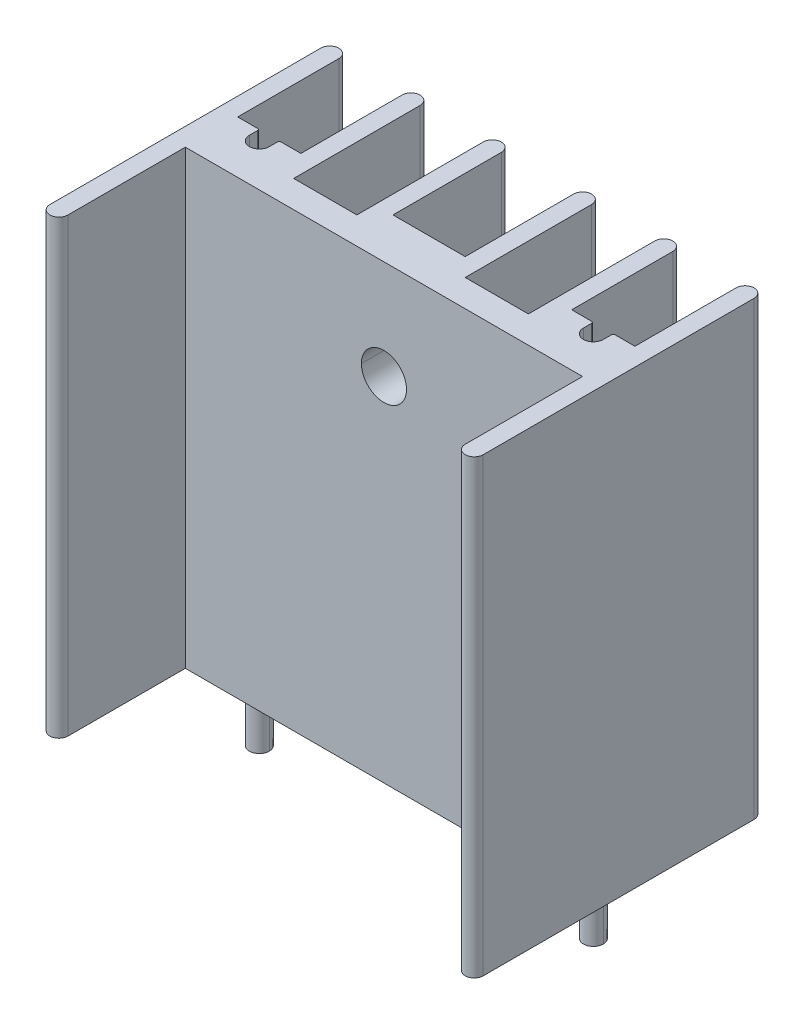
ISO-10303-21;
HEADER;
FILE_DESCRIPTION(('STEP AP214'),'2;1');
FILE_NAME('part.step','',(''),(''),'','','');
FILE_SCHEMA(('AUTOMOTIVE_DESIGN { 1 0 10303 214 1 1 1 1 }'));
ENDSEC;
DATA;
#1=APPLICATION_CONTEXT('core data for automotive mechanical design processes');
#2=APPLICATION_PROTOCOL_DEFINITION('international standard','automotive_design',2000,#1);
#3=PRODUCT_CONTEXT('',#1,'mechanical');
#4=PRODUCT('Part','Part','',(#3));
#5=PRODUCT_RELATED_PRODUCT_CATEGORY('part','',(#4));
#6=PRODUCT_DEFINITION_FORMATION('','',#4);
#7=PRODUCT_DEFINITION_CONTEXT('part definition',#1,'design');
#8=PRODUCT_DEFINITION('design','',#6,#7);
#9=PRODUCT_DEFINITION_SHAPE('','',#8);
#10=(LENGTH_UNIT() NAMED_UNIT(*) SI_UNIT(.MILLI.,.METRE.));
#11=(NAMED_UNIT(*) PLANE_ANGLE_UNIT() SI_UNIT($,.RADIAN.));
#12=(NAMED_UNIT(*) SI_UNIT($,.STERADIAN.) SOLID_ANGLE_UNIT());
#13=UNCERTAINTY_MEASURE_WITH_UNIT(LENGTH_MEASURE(1.E-05),#10,'distance_accuracy_value','');
#14=(GEOMETRIC_REPRESENTATION_CONTEXT(3) GLOBAL_UNCERTAINTY_ASSIGNED_CONTEXT((#13)) GLOBAL_UNIT_ASSIGNED_CONTEXT((#10,
#11,#12)) REPRESENTATION_CONTEXT('',''));
#15=CARTESIAN_POINT('',(0.,0.,0.));
#16=DIRECTION('',(0.,0.,1.));
#17=DIRECTION('',(1.,0.,0.));
#18=AXIS2_PLACEMENT_3D('',#15,#16,#17);
#19=CARTESIAN_POINT('',(0.,-4.,0.));
#20=DIRECTION('',(0.,-1.,0.));
#21=DIRECTION('',(-1.,0.,0.));
#22=AXIS2_PLACEMENT_3D('',#19,#20,#21);
#23=PLANE('',#22);
#24=CARTESIAN_POINT('',(2.75,-4.,-9.35));
#25=DIRECTION('',(0.,-1.,0.));
#26=DIRECTION('',(1.,0.,0.));
#27=AXIS2_PLACEMENT_3D('',#24,#25,#26);
#28=CIRCLE('',#27,0.55);
#29=CARTESIAN_POINT('',(3.3,-4.,-9.35));
#30=VERTEX_POINT('',#29);
#31=CARTESIAN_POINT('',(2.2,-4.,-9.35));
#32=VERTEX_POINT('',#31);
#33=EDGE_CURVE('E152',#30,#32,#28,.T.);
#34=ORIENTED_EDGE('',*,*,#33,.T.);
#35=CARTESIAN_POINT('',(2.75,-4.,-9.35));
#36=DIRECTION('',(0.,-1.,0.));
#37=DIRECTION('',(-1.,0.,0.));
#38=AXIS2_PLACEMENT_3D('',#35,#36,#37);
#39=CIRCLE('',#38,0.55);
#40=EDGE_CURVE('E146',#32,#30,#39,.T.);
#41=ORIENTED_EDGE('',*,*,#40,.T.);
#42=EDGE_LOOP('',(#34,#41));
#43=FACE_BOUND('',#42,.T.);
#44=ADVANCED_FACE('F16',(#43),#23,.T.);
#45=CARTESIAN_POINT('',(0.,6.,0.));
#46=DIRECTION('',(0.,-1.,0.));
#47=DIRECTION('',(-1.,0.,0.));
#48=AXIS2_PLACEMENT_3D('',#45,#46,#47);
#49=PLANE('',#48);
#50=CARTESIAN_POINT('',(2.75,6.,-9.35));
#51=DIRECTION('',(0.,-1.,0.));
#52=DIRECTION('',(-1.,0.,0.));
#53=AXIS2_PLACEMENT_3D('',#50,#51,#52);
#54=CIRCLE('',#53,0.55);
#55=CARTESIAN_POINT('',(2.2,6.,-9.35));
#56=VERTEX_POINT('',#55);
#57=CARTESIAN_POINT('',(3.3,6.,-9.35));
#58=VERTEX_POINT('',#57);
#59=EDGE_CURVE('E104',#56,#58,#54,.T.);
#60=ORIENTED_EDGE('',*,*,#59,.F.);
#61=CARTESIAN_POINT('',(2.75,6.00000000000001,-9.35));
#62=DIRECTION('',(0.,1.,0.));
#63=DIRECTION('',(-1.,0.,0.));
#64=AXIS2_PLACEMENT_3D('',#61,#62,#63);
#65=CIRCLE('',#64,0.55);
#66=EDGE_CURVE('E10',#56,#58,#65,.T.);
#67=ORIENTED_EDGE('',*,*,#66,.T.);
#68=EDGE_LOOP('',(#60,#67));
#69=FACE_BOUND('',#68,.T.);
#70=ADVANCED_FACE('F105',(#69),#49,.F.);
#71=CARTESIAN_POINT('',(2.75,-32.59,-9.35));
#72=DIRECTION('',(0.,1.,0.));
#73=DIRECTION('',(-1.,0.,0.));
#74=AXIS2_PLACEMENT_3D('',#71,#72,#73);
#75=CYLINDRICAL_SURFACE('',#74,0.55);
#76=DIRECTION('',(0.,1.,0.));
#77=VECTOR('',#76,1.);
#78=CARTESIAN_POINT('',(2.2,6.00000000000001,-9.35));
#79=LINE('',#78,#77);
#80=CARTESIAN_POINT('',(2.2,25.,-9.35));
#81=VERTEX_POINT('',#80);
#82=EDGE_CURVE('E118',#56,#81,#79,.T.);
#83=ORIENTED_EDGE('',*,*,#82,.T.);
#84=CARTESIAN_POINT('',(2.75,25.,-9.35));
#85=DIRECTION('',(0.,1.,0.));
#86=DIRECTION('',(-1.,0.,0.));
#87=AXIS2_PLACEMENT_3D('',#84,#85,#86);
#88=CIRCLE('',#87,0.55);
#89=CARTESIAN_POINT('',(3.3,25.,-9.35));
#90=VERTEX_POINT('',#89);
#91=EDGE_CURVE('E556',#81,#90,#88,.T.);
#92=ORIENTED_EDGE('',*,*,#91,.T.);
#93=DIRECTION('',(0.,1.,0.));
#94=VECTOR('',#93,1.);
#95=CARTESIAN_POINT('',(3.3,6.00000000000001,-9.35));
#96=LINE('',#95,#94);
#97=EDGE_CURVE('E24',#58,#90,#96,.T.);
#98=ORIENTED_EDGE('',*,*,#97,.F.);
#99=ORIENTED_EDGE('',*,*,#66,.F.);
#100=EDGE_LOOP('',(#83,#92,#98,#99));
#101=FACE_BOUND('',#100,.T.);
#102=ADVANCED_FACE('F114',(#101),#75,.F.);
#103=CARTESIAN_POINT('',(3.4,0.1,-9.26662485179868));
#104=DIRECTION('',(0.,0.,-1.));
#105=DIRECTION('',(0.,-1.,0.));
#106=AXIS2_PLACEMENT_3D('',#103,#104,#105);
#107=CYLINDRICAL_SURFACE('',#106,0.1);
#108=CARTESIAN_POINT('',(3.4,0.1,-9.8));
#109=DIRECTION('',(0.,0.,-1.));
#110=DIRECTION('',(0.,-1.,0.));
#111=AXIS2_PLACEMENT_3D('',#108,#109,#110);
#112=CIRCLE('',#111,0.1);
#113=CARTESIAN_POINT('',(3.4,0.,-9.8));
#114=VERTEX_POINT('',#113);
#115=CARTESIAN_POINT('',(3.3,0.100000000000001,-9.79999999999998));
#116=VERTEX_POINT('',#115);
#117=EDGE_CURVE('E360',#114,#116,#112,.T.);
#118=ORIENTED_EDGE('',*,*,#117,.F.);
#119=DIRECTION('',(0.,0.,-1.));
#120=VECTOR('',#119,1.);
#121=CARTESIAN_POINT('',(3.4,0.,-9.35));
#122=LINE('',#121,#120);
#123=CARTESIAN_POINT('',(3.4,0.,-9.35));
#124=VERTEX_POINT('',#123);
#125=EDGE_CURVE('E57',#124,#114,#122,.T.);
#126=ORIENTED_EDGE('',*,*,#125,.F.);
#127=CARTESIAN_POINT('',(3.4,0.1,-9.35));
#128=DIRECTION('',(0.,0.,-1.));
#129=DIRECTION('',(-1.,0.,0.));
#130=AXIS2_PLACEMENT_3D('',#127,#128,#129);
#131=CIRCLE('',#130,0.1);
#132=CARTESIAN_POINT('',(3.3,0.100000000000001,-9.35));
#133=VERTEX_POINT('',#132);
#134=EDGE_CURVE('E19',#124,#133,#131,.T.);
#135=ORIENTED_EDGE('',*,*,#134,.T.);
#136=DIRECTION('',(0.,0.,-1.));
#137=VECTOR('',#136,1.);
#138=CARTESIAN_POINT('',(3.3,0.1,-9.35));
#139=LINE('',#138,#137);
#140=EDGE_CURVE('E63',#133,#116,#139,.T.);
#141=ORIENTED_EDGE('',*,*,#140,.T.);
#142=EDGE_LOOP('',(#118,#126,#135,#141));
#143=FACE_BOUND('',#142,.T.);
#144=ADVANCED_FACE('F474',(#143),#107,.T.);
#145=CARTESIAN_POINT('',(3.3,0.,-9.9));
#146=DIRECTION('',(1.,0.,0.));
#147=DIRECTION('',(0.,0.,1.));
#148=AXIS2_PLACEMENT_3D('',#145,#146,#147);
#149=PLANE('',#148);
#150=ORIENTED_EDGE('',*,*,#97,.T.);
#151=DIRECTION('',(0.,0.,1.));
#152=VECTOR('',#151,1.);
#153=CARTESIAN_POINT('',(3.3,25.,-9.8));
#154=LINE('',#153,#152);
#155=CARTESIAN_POINT('',(3.3,25.,-9.8));
#156=VERTEX_POINT('',#155);
#157=EDGE_CURVE('E558',#156,#90,#154,.T.);
#158=ORIENTED_EDGE('',*,*,#157,.F.);
#159=DIRECTION('',(0.,1.,0.));
#160=VECTOR('',#159,1.);
#161=CARTESIAN_POINT('',(3.3,0.100000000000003,-9.8));
#162=LINE('',#161,#160);
#163=EDGE_CURVE('E363',#116,#156,#162,.T.);
#164=ORIENTED_EDGE('',*,*,#163,.F.);
#165=ORIENTED_EDGE('',*,*,#140,.F.);
#166=DIRECTION('',(0.,-1.,0.));
#167=VECTOR('',#166,1.);
#168=CARTESIAN_POINT('',(3.3,6.,-9.35));
#169=LINE('',#168,#167);
#170=EDGE_CURVE('E110',#58,#133,#169,.T.);
#171=ORIENTED_EDGE('',*,*,#170,.F.);
#172=EDGE_LOOP('',(#150,#158,#164,#165,#171));
#173=FACE_BOUND('',#172,.T.);
#174=ADVANCED_FACE('F677',(#173),#149,.F.);
#175=CARTESIAN_POINT('',(3.4,-32.59,-9.8));
#176=DIRECTION('',(0.,1.,0.));
#177=DIRECTION('',(0.,0.,-1.));
#178=AXIS2_PLACEMENT_3D('',#175,#176,#177);
#179=CYLINDRICAL_SURFACE('',#178,0.1);
#180=ORIENTED_EDGE('',*,*,#163,.T.);
#181=CARTESIAN_POINT('',(3.4,25.,-9.8));
#182=DIRECTION('',(0.,1.,0.));
#183=DIRECTION('',(0.,0.,-1.));
#184=AXIS2_PLACEMENT_3D('',#181,#182,#183);
#185=CIRCLE('',#184,0.1);
#186=CARTESIAN_POINT('',(3.4,25.,-9.9));
#187=VERTEX_POINT('',#186);
#188=EDGE_CURVE('E561',#187,#156,#185,.T.);
#189=ORIENTED_EDGE('',*,*,#188,.F.);
#190=DIRECTION('',(0.,1.,0.));
#191=VECTOR('',#190,1.);
#192=CARTESIAN_POINT('',(3.4,0.100000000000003,-9.9));
#193=LINE('',#192,#191);
#194=CARTESIAN_POINT('',(3.3999999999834,0.100000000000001,-9.9));
#195=VERTEX_POINT('',#194);
#196=EDGE_CURVE('E348',#195,#187,#193,.T.);
#197=ORIENTED_EDGE('',*,*,#196,.F.);
#198=CARTESIAN_POINT('',(3.4,0.100000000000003,-9.8));
#199=DIRECTION('',(0.,-1.,0.));
#200=DIRECTION('',(-1.,0.,0.));
#201=AXIS2_PLACEMENT_3D('',#198,#199,#200);
#202=CIRCLE('',#201,0.1);
#203=EDGE_CURVE('E357',#116,#195,#202,.T.);
#204=ORIENTED_EDGE('',*,*,#203,.F.);
#205=EDGE_LOOP('',(#180,#189,#197,#204));
#206=FACE_BOUND('',#205,.T.);
#207=ADVANCED_FACE('F679',(#206),#179,.T.);
#208=CARTESIAN_POINT('',(3.4,0.1,-9.8));
#209=DIRECTION('',(-0.707106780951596,0.,0.7071067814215));
#210=DIRECTION('',(-0.7071067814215,0.,-0.707106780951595));
#211=AXIS2_PLACEMENT_3D('',#208,#209,#210);
#212=SPHERICAL_SURFACE('',#211,0.1);
#213=CARTESIAN_POINT('',(3.4,0.1,-9.8));
#214=DIRECTION('',(1.,0.,0.));
#215=DIRECTION('',(0.,-1.,0.));
#216=AXIS2_PLACEMENT_3D('',#213,#214,#215);
#217=CIRCLE('',#216,0.1);
#218=EDGE_CURVE('E354',#114,#195,#217,.T.);
#219=ORIENTED_EDGE('',*,*,#218,.F.);
#220=ORIENTED_EDGE('',*,*,#117,.T.);
#221=ORIENTED_EDGE('',*,*,#203,.T.);
#222=EDGE_LOOP('',(#219,#220,#221));
#223=FACE_BOUND('',#222,.T.);
#224=ADVANCED_FACE('F477',(#223),#212,.T.);
#225=CARTESIAN_POINT('',(0.916624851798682,0.1,-9.8));
#226=DIRECTION('',(1.,0.,0.));
#227=DIRECTION('',(0.,-1.,0.));
#228=AXIS2_PLACEMENT_3D('',#225,#226,#227);
#229=CYLINDRICAL_SURFACE('',#228,0.1);
#230=CARTESIAN_POINT('',(4.5,0.1,-9.8));
#231=DIRECTION('',(1.,0.,0.));
#232=DIRECTION('',(0.,-1.,0.));
#233=AXIS2_PLACEMENT_3D('',#230,#231,#232);
#234=CIRCLE('',#233,0.1);
#235=CARTESIAN_POINT('',(4.5,0.,-9.8));
#236=VERTEX_POINT('',#235);
#237=CARTESIAN_POINT('',(4.5,0.1,-9.9));
#238=VERTEX_POINT('',#237);
#239=EDGE_CURVE('E349',#236,#238,#234,.T.);
#240=ORIENTED_EDGE('',*,*,#239,.F.);
#241=DIRECTION('',(1.,0.,0.));
#242=VECTOR('',#241,1.);
#243=CARTESIAN_POINT('',(3.40000000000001,0.,-9.8));
#244=LINE('',#243,#242);
#245=EDGE_CURVE('E340',#114,#236,#244,.T.);
#246=ORIENTED_EDGE('',*,*,#245,.F.);
#247=ORIENTED_EDGE('',*,*,#218,.T.);
#248=DIRECTION('',(1.,0.,0.));
#249=VECTOR('',#248,1.);
#250=CARTESIAN_POINT('',(3.4,0.1,-9.9));
#251=LINE('',#250,#249);
#252=EDGE_CURVE('E345',#195,#238,#251,.T.);
#253=ORIENTED_EDGE('',*,*,#252,.T.);
#254=EDGE_LOOP('',(#240,#246,#247,#253));
#255=FACE_BOUND('',#254,.T.);
#256=ADVANCED_FACE('F482',(#255),#229,.T.);
#257=CARTESIAN_POINT('',(4.5,0.,-9.9));
#258=DIRECTION('',(0.,0.,-1.));
#259=DIRECTION('',(-1.,0.,0.));
#260=AXIS2_PLACEMENT_3D('',#257,#258,#259);
#261=PLANE('',#260);
#262=ORIENTED_EDGE('',*,*,#196,.T.);
#263=DIRECTION('',(-1.,0.,0.));
#264=VECTOR('',#263,1.);
#265=CARTESIAN_POINT('',(4.5,25.,-9.9));
#266=LINE('',#265,#264);
#267=CARTESIAN_POINT('',(4.5,25.,-9.9));
#268=VERTEX_POINT('',#267);
#269=EDGE_CURVE('E564',#268,#187,#266,.T.);
#270=ORIENTED_EDGE('',*,*,#269,.F.);
#271=DIRECTION('',(0.,1.,0.));
#272=VECTOR('',#271,1.);
#273=CARTESIAN_POINT('',(4.5,0.1,-9.9));
#274=LINE('',#273,#272);
#275=EDGE_CURVE('E344',#238,#268,#274,.T.);
#276=ORIENTED_EDGE('',*,*,#275,.F.);
#277=ORIENTED_EDGE('',*,*,#252,.F.);
#278=EDGE_LOOP('',(#262,#270,#276,#277));
#279=FACE_BOUND('',#278,.T.);
#280=ADVANCED_FACE('F682',(#279),#261,.T.);
#281=CARTESIAN_POINT('',(4.5,0.,-16.));
#282=DIRECTION('',(-1.,0.,0.));
#283=DIRECTION('',(0.,0.,1.));
#284=AXIS2_PLACEMENT_3D('',#281,#282,#283);
#285=PLANE('',#284);
#286=DIRECTION('',(0.,0.,1.));
#287=VECTOR('',#286,1.);
#288=CARTESIAN_POINT('',(4.5,25.,-15.5));
#289=LINE('',#288,#287);
#290=CARTESIAN_POINT('',(4.5,25.,-15.5));
#291=VERTEX_POINT('',#290);
#292=EDGE_CURVE('E567',#291,#268,#289,.T.);
#293=ORIENTED_EDGE('',*,*,#292,.F.);
#294=DIRECTION('',(0.,-1.,0.));
#295=VECTOR('',#294,1.);
#296=CARTESIAN_POINT('',(4.5,25.,-15.5));
#297=LINE('',#296,#295);
#298=CARTESIAN_POINT('',(4.5,0.,-15.5));
#299=VERTEX_POINT('',#298);
#300=EDGE_CURVE('E334',#291,#299,#297,.T.);
#301=ORIENTED_EDGE('',*,*,#300,.T.);
#302=DIRECTION('',(0.,0.,-1.));
#303=VECTOR('',#302,1.);
#304=CARTESIAN_POINT('',(4.5,0.,-9.8));
#305=LINE('',#304,#303);
#306=EDGE_CURVE('E337',#236,#299,#305,.T.);
#307=ORIENTED_EDGE('',*,*,#306,.F.);
#308=ORIENTED_EDGE('',*,*,#239,.T.);
#309=ORIENTED_EDGE('',*,*,#275,.T.);
#310=EDGE_LOOP('',(#293,#301,#307,#308,#309));
#311=FACE_BOUND('',#310,.T.);
#312=ADVANCED_FACE('F692',(#311),#285,.T.);
#313=CARTESIAN_POINT('',(5.,57.59,-15.5));
#314=DIRECTION('',(0.,-1.,0.));
#315=DIRECTION('',(-1.,0.,0.));
#316=AXIS2_PLACEMENT_3D('',#313,#314,#315);
#317=CYLINDRICAL_SURFACE('',#316,0.5);
#318=ORIENTED_EDGE('',*,*,#300,.F.);
#319=CARTESIAN_POINT('',(5.,25.,-15.5));
#320=DIRECTION('',(0.,-1.,0.));
#321=DIRECTION('',(-1.,0.,0.));
#322=AXIS2_PLACEMENT_3D('',#319,#320,#321);
#323=CIRCLE('',#322,0.5);
#324=CARTESIAN_POINT('',(5.5,25.,-15.5));
#325=VERTEX_POINT('',#324);
#326=EDGE_CURVE('E570',#291,#325,#323,.T.);
#327=ORIENTED_EDGE('',*,*,#326,.T.);
#328=DIRECTION('',(0.,-1.,0.));
#329=VECTOR('',#328,1.);
#330=CARTESIAN_POINT('',(5.5,25.,-15.5));
#331=LINE('',#330,#329);
#332=CARTESIAN_POINT('',(5.5,0.,-15.5));
#333=VERTEX_POINT('',#332);
#334=EDGE_CURVE('E331',#325,#333,#331,.T.);
#335=ORIENTED_EDGE('',*,*,#334,.T.);
#336=CARTESIAN_POINT('',(5.,0.,-15.5));
#337=DIRECTION('',(0.,1.,0.));
#338=DIRECTION('',(1.,0.,0.));
#339=AXIS2_PLACEMENT_3D('',#336,#337,#338);
#340=CIRCLE('',#339,0.5);
#341=EDGE_CURVE('E341',#333,#299,#340,.T.);
#342=ORIENTED_EDGE('',*,*,#341,.T.);
#343=EDGE_LOOP('',(#318,#327,#335,#342));
#344=FACE_BOUND('',#343,.T.);
#345=ADVANCED_FACE('F699',(#344),#317,.T.);
#346=CARTESIAN_POINT('',(5.5,0.,-8.5));
#347=DIRECTION('',(1.,0.,0.));
#348=DIRECTION('',(0.,0.,-1.));
#349=AXIS2_PLACEMENT_3D('',#346,#347,#348);
#350=PLANE('',#349);
#351=DIRECTION('',(0.,0.,-1.));
#352=VECTOR('',#351,1.);
#353=CARTESIAN_POINT('',(5.5,25.,-8.5));
#354=LINE('',#353,#352);
#355=CARTESIAN_POINT('',(5.5,25.,-8.5));
#356=VERTEX_POINT('',#355);
#357=EDGE_CURVE('E573',#356,#325,#354,.T.);
#358=ORIENTED_EDGE('',*,*,#357,.F.);
#359=DIRECTION('',(0.,1.,0.));
#360=VECTOR('',#359,1.);
#361=CARTESIAN_POINT('',(5.5,0.,-8.5));
#362=LINE('',#361,#360);
#363=CARTESIAN_POINT('',(5.5,0.,-8.5));
#364=VERTEX_POINT('',#363);
#365=EDGE_CURVE('E330',#364,#356,#362,.T.);
#366=ORIENTED_EDGE('',*,*,#365,.F.);
#367=DIRECTION('',(0.,0.,-1.));
#368=VECTOR('',#367,1.);
#369=CARTESIAN_POINT('',(5.5,0.,-8.5));
#370=LINE('',#369,#368);
#371=EDGE_CURVE('E706',#364,#333,#370,.T.);
#372=ORIENTED_EDGE('',*,*,#371,.T.);
#373=ORIENTED_EDGE('',*,*,#334,.F.);
#374=EDGE_LOOP('',(#358,#366,#372,#373));
#375=FACE_BOUND('',#374,.T.);
#376=ADVANCED_FACE('F962',(#375),#350,.T.);
#377=CARTESIAN_POINT('',(9.,0.,-8.5));
#378=DIRECTION('',(0.,0.,-1.));
#379=DIRECTION('',(-1.,0.,0.));
#380=AXIS2_PLACEMENT_3D('',#377,#378,#379);
#381=PLANE('',#380);
#382=ORIENTED_EDGE('',*,*,#365,.T.);
#383=DIRECTION('',(-1.,0.,0.));
#384=VECTOR('',#383,1.);
#385=CARTESIAN_POINT('',(9.,25.,-8.5));
#386=LINE('',#385,#384);
#387=CARTESIAN_POINT('',(9.,25.,-8.5));
#388=VERTEX_POINT('',#387);
#389=EDGE_CURVE('E576',#388,#356,#386,.T.);
#390=ORIENTED_EDGE('',*,*,#389,.F.);
#391=DIRECTION('',(0.,1.,0.));
#392=VECTOR('',#391,1.);
#393=CARTESIAN_POINT('',(9.,0.,-8.5));
#394=LINE('',#393,#392);
#395=CARTESIAN_POINT('',(9.,0.,-8.5));
#396=VERTEX_POINT('',#395);
#397=EDGE_CURVE('E327',#396,#388,#394,.T.);
#398=ORIENTED_EDGE('',*,*,#397,.F.);
#399=DIRECTION('',(-1.,0.,0.));
#400=VECTOR('',#399,1.);
#401=CARTESIAN_POINT('',(9.,0.,-8.5));
#402=LINE('',#401,#400);
#403=EDGE_CURVE('E707',#396,#364,#402,.T.);
#404=ORIENTED_EDGE('',*,*,#403,.T.);
#405=EDGE_LOOP('',(#382,#390,#398,#404));
#406=FACE_BOUND('',#405,.T.);
#407=ADVANCED_FACE('F965',(#406),#381,.T.);
#408=CARTESIAN_POINT('',(9.,0.,-16.));
#409=DIRECTION('',(-1.,0.,0.));
#410=DIRECTION('',(0.,0.,1.));
#411=AXIS2_PLACEMENT_3D('',#408,#409,#410);
#412=PLANE('',#411);
#413=DIRECTION('',(0.,0.,1.));
#414=VECTOR('',#413,1.);
#415=CARTESIAN_POINT('',(9.,0.,-15.5));
#416=LINE('',#415,#414);
#417=CARTESIAN_POINT('',(9.,0.,-15.5));
#418=VERTEX_POINT('',#417);
#419=EDGE_CURVE('E712',#418,#396,#416,.T.);
#420=ORIENTED_EDGE('',*,*,#419,.T.);
#421=ORIENTED_EDGE('',*,*,#397,.T.);
#422=DIRECTION('',(0.,0.,1.));
#423=VECTOR('',#422,1.);
#424=CARTESIAN_POINT('',(9.,25.,-15.5));
#425=LINE('',#424,#423);
#426=CARTESIAN_POINT('',(9.,25.,-15.5));
#427=VERTEX_POINT('',#426);
#428=EDGE_CURVE('E579',#427,#388,#425,.T.);
#429=ORIENTED_EDGE('',*,*,#428,.F.);
#430=DIRECTION('',(0.,-1.,0.));
#431=VECTOR('',#430,1.);
#432=CARTESIAN_POINT('',(9.,25.,-15.5));
#433=LINE('',#432,#431);
#434=EDGE_CURVE('E322',#427,#418,#433,.T.);
#435=ORIENTED_EDGE('',*,*,#434,.T.);
#436=EDGE_LOOP('',(#420,#421,#429,#435));
#437=FACE_BOUND('',#436,.T.);
#438=ADVANCED_FACE('F969',(#437),#412,.T.);
#439=CARTESIAN_POINT('',(9.5,57.59,-15.5));
#440=DIRECTION('',(0.,-1.,0.));
#441=DIRECTION('',(-1.,0.,0.));
#442=AXIS2_PLACEMENT_3D('',#439,#440,#441);
#443=CYLINDRICAL_SURFACE('',#442,0.5);
#444=ORIENTED_EDGE('',*,*,#434,.F.);
#445=CARTESIAN_POINT('',(9.5,25.,-15.5));
#446=DIRECTION('',(0.,-1.,0.));
#447=DIRECTION('',(-1.,0.,0.));
#448=AXIS2_PLACEMENT_3D('',#445,#446,#447);
#449=CIRCLE('',#448,0.5);
#450=CARTESIAN_POINT('',(10.,25.,-15.5));
#451=VERTEX_POINT('',#450);
#452=EDGE_CURVE('E582',#427,#451,#449,.T.);
#453=ORIENTED_EDGE('',*,*,#452,.T.);
#454=DIRECTION('',(0.,-1.,0.));
#455=VECTOR('',#454,1.);
#456=CARTESIAN_POINT('',(10.,25.,-15.5));
#457=LINE('',#456,#455);
#458=CARTESIAN_POINT('',(10.,0.,-15.5));
#459=VERTEX_POINT('',#458);
#460=EDGE_CURVE('E311',#451,#459,#457,.T.);
#461=ORIENTED_EDGE('',*,*,#460,.T.);
#462=CARTESIAN_POINT('',(9.5,0.,-15.5));
#463=DIRECTION('',(0.,1.,0.));
#464=DIRECTION('',(1.,0.,0.));
#465=AXIS2_PLACEMENT_3D('',#462,#463,#464);
#466=CIRCLE('',#465,0.5);
#467=EDGE_CURVE('E715',#459,#418,#466,.T.);
#468=ORIENTED_EDGE('',*,*,#467,.T.);
#469=EDGE_LOOP('',(#444,#453,#461,#468));
#470=FACE_BOUND('',#469,.T.);
#471=ADVANCED_FACE('F973',(#470),#443,.T.);
#472=CARTESIAN_POINT('',(10.,0.,-9.5));
#473=DIRECTION('',(1.,0.,0.));
#474=DIRECTION('',(0.,0.,-1.));
#475=AXIS2_PLACEMENT_3D('',#472,#473,#474);
#476=PLANE('',#475);
#477=DIRECTION('',(0.,0.,-1.));
#478=VECTOR('',#477,1.);
#479=CARTESIAN_POINT('',(10.,25.,-9.5));
#480=LINE('',#479,#478);
#481=CARTESIAN_POINT('',(10.,25.,-9.5));
#482=VERTEX_POINT('',#481);
#483=EDGE_CURVE('E585',#482,#451,#480,.T.);
#484=ORIENTED_EDGE('',*,*,#483,.F.);
#485=DIRECTION('',(0.,1.,0.));
#486=VECTOR('',#485,1.);
#487=CARTESIAN_POINT('',(10.,0.,-9.5));
#488=LINE('',#487,#486);
#489=CARTESIAN_POINT('',(10.,0.,-9.5));
#490=VERTEX_POINT('',#489);
#491=EDGE_CURVE('E219',#490,#482,#488,.T.);
#492=ORIENTED_EDGE('',*,*,#491,.F.);
#493=DIRECTION('',(0.,0.,-1.));
#494=VECTOR('',#493,1.);
#495=CARTESIAN_POINT('',(10.,0.,-9.5));
#496=LINE('',#495,#494);
#497=EDGE_CURVE('E718',#490,#459,#496,.T.);
#498=ORIENTED_EDGE('',*,*,#497,.T.);
#499=ORIENTED_EDGE('',*,*,#460,.F.);
#500=EDGE_LOOP('',(#484,#492,#498,#499));
#501=FACE_BOUND('',#500,.T.);
#502=ADVANCED_FACE('F977',(#501),#476,.T.);
#503=CARTESIAN_POINT('',(23.,0.,-9.9));
#504=DIRECTION('',(0.,0.,-1.));
#505=DIRECTION('',(-1.,0.,0.));
#506=AXIS2_PLACEMENT_3D('',#503,#504,#505);
#507=PLANE('',#506);
#508=DIRECTION('',(0.,1.,0.));
#509=VECTOR('',#508,1.);
#510=CARTESIAN_POINT('',(19.5,0.1,-9.9));
#511=LINE('',#510,#509);
#512=CARTESIAN_POINT('',(19.5,0.1,-9.9));
#513=VERTEX_POINT('',#512);
#514=CARTESIAN_POINT('',(19.5,25.,-9.9));
#515=VERTEX_POINT('',#514);
#516=EDGE_CURVE('E245',#513,#515,#511,.T.);
#517=ORIENTED_EDGE('',*,*,#516,.T.);
#518=DIRECTION('',(-1.,0.,0.));
#519=VECTOR('',#518,1.);
#520=CARTESIAN_POINT('',(20.6,25.,-9.9));
#521=LINE('',#520,#519);
#522=CARTESIAN_POINT('',(20.6,25.,-9.9));
#523=VERTEX_POINT('',#522);
#524=EDGE_CURVE('E612',#523,#515,#521,.T.);
#525=ORIENTED_EDGE('',*,*,#524,.F.);
#526=DIRECTION('',(0.,-1.,0.));
#527=VECTOR('',#526,1.);
#528=CARTESIAN_POINT('',(20.6,25.,-9.9));
#529=LINE('',#528,#527);
#530=CARTESIAN_POINT('',(20.6000000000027,0.0999999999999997,-9.9));
#531=VERTEX_POINT('',#530);
#532=EDGE_CURVE('E265',#523,#531,#529,.T.);
#533=ORIENTED_EDGE('',*,*,#532,.T.);
#534=DIRECTION('',(1.,0.,0.));
#535=VECTOR('',#534,1.);
#536=CARTESIAN_POINT('',(19.5,0.1,-9.9));
#537=LINE('',#536,#535);
#538=EDGE_CURVE('E256',#513,#531,#537,.T.);
#539=ORIENTED_EDGE('',*,*,#538,.F.);
#540=EDGE_LOOP('',(#517,#525,#533,#539));
#541=FACE_BOUND('',#540,.T.);
#542=ADVANCED_FACE('F981',(#541),#507,.T.);
#543=CARTESIAN_POINT('',(0.,-4.,0.));
#544=DIRECTION('',(0.,-1.,0.));
#545=DIRECTION('',(-1.,0.,0.));
#546=AXIS2_PLACEMENT_3D('',#543,#544,#545);
#547=PLANE('',#546);
#548=CARTESIAN_POINT('',(21.25,-4.,-9.35));
#549=DIRECTION('',(0.,-1.,0.));
#550=DIRECTION('',(1.,0.,0.));
#551=AXIS2_PLACEMENT_3D('',#548,#549,#550);
#552=CIRCLE('',#551,0.55);
#553=CARTESIAN_POINT('',(21.8,-4.,-9.35));
#554=VERTEX_POINT('',#553);
#555=CARTESIAN_POINT('',(20.7,-4.,-9.35));
#556=VERTEX_POINT('',#555);
#557=EDGE_CURVE('E285',#554,#556,#552,.T.);
#558=ORIENTED_EDGE('',*,*,#557,.T.);
#559=CARTESIAN_POINT('',(21.25,-4.,-9.35));
#560=DIRECTION('',(0.,-1.,0.));
#561=DIRECTION('',(-1.,0.,0.));
#562=AXIS2_PLACEMENT_3D('',#559,#560,#561);
#563=CIRCLE('',#562,0.55);
#564=EDGE_CURVE('E277',#556,#554,#563,.T.);
#565=ORIENTED_EDGE('',*,*,#564,.T.);
#566=EDGE_LOOP('',(#558,#565));
#567=FACE_BOUND('',#566,.T.);
#568=ADVANCED_FACE('F985',(#567),#547,.T.);
#569=CARTESIAN_POINT('',(0.,6.,0.));
#570=DIRECTION('',(0.,-1.,0.));
#571=DIRECTION('',(-1.,0.,0.));
#572=AXIS2_PLACEMENT_3D('',#569,#570,#571);
#573=PLANE('',#572);
#574=CARTESIAN_POINT('',(21.25,6.,-9.35));
#575=DIRECTION('',(0.,-1.,0.));
#576=DIRECTION('',(-1.,0.,0.));
#577=AXIS2_PLACEMENT_3D('',#574,#575,#576);
#578=CIRCLE('',#577,0.55);
#579=CARTESIAN_POINT('',(20.7,6.,-9.35));
#580=VERTEX_POINT('',#579);
#581=CARTESIAN_POINT('',(21.8,6.,-9.35));
#582=VERTEX_POINT('',#581);
#583=EDGE_CURVE('E278',#580,#582,#578,.T.);
#584=ORIENTED_EDGE('',*,*,#583,.F.);
#585=CARTESIAN_POINT('',(21.25,6.00000000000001,-9.35));
#586=DIRECTION('',(0.,1.,0.));
#587=DIRECTION('',(-1.,0.,0.));
#588=AXIS2_PLACEMENT_3D('',#585,#586,#587);
#589=CIRCLE('',#588,0.55);
#590=EDGE_CURVE('E307',#580,#582,#589,.T.);
#591=ORIENTED_EDGE('',*,*,#590,.T.);
#592=EDGE_LOOP('',(#584,#591));
#593=FACE_BOUND('',#592,.T.);
#594=ADVANCED_FACE('F989',(#593),#573,.F.);
#595=CARTESIAN_POINT('',(21.25,-32.59,-9.35));
#596=DIRECTION('',(0.,1.,0.));
#597=DIRECTION('',(0.,0.,1.));
#598=AXIS2_PLACEMENT_3D('',#595,#596,#597);
#599=CYLINDRICAL_SURFACE('',#598,0.55);
#600=DIRECTION('',(0.,1.,0.));
#601=VECTOR('',#600,1.);
#602=CARTESIAN_POINT('',(20.7,6.00000000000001,-9.35));
#603=LINE('',#602,#601);
#604=CARTESIAN_POINT('',(20.7,25.,-9.35));
#605=VERTEX_POINT('',#604);
#606=EDGE_CURVE('E264',#580,#605,#603,.T.);
#607=ORIENTED_EDGE('',*,*,#606,.T.);
#608=CARTESIAN_POINT('',(21.25,25.,-9.35));
#609=DIRECTION('',(0.,1.,0.));
#610=DIRECTION('',(-1.,0.,0.));
#611=AXIS2_PLACEMENT_3D('',#608,#609,#610);
#612=CIRCLE('',#611,0.55);
#613=CARTESIAN_POINT('',(21.8,25.,-9.35));
#614=VERTEX_POINT('',#613);
#615=EDGE_CURVE('E621',#605,#614,#612,.T.);
#616=ORIENTED_EDGE('',*,*,#615,.T.);
#617=DIRECTION('',(0.,1.,0.));
#618=VECTOR('',#617,1.);
#619=CARTESIAN_POINT('',(21.8,6.00000000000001,-9.35));
#620=LINE('',#619,#618);
#621=EDGE_CURVE('E301',#582,#614,#620,.T.);
#622=ORIENTED_EDGE('',*,*,#621,.F.);
#623=ORIENTED_EDGE('',*,*,#590,.F.);
#624=EDGE_LOOP('',(#607,#616,#622,#623));
#625=FACE_BOUND('',#624,.T.);
#626=ADVANCED_FACE('F993',(#625),#599,.F.);
#627=CARTESIAN_POINT('',(21.9,0.1,-9.8));
#628=DIRECTION('',(-0.707106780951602,0.,0.707106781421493));
#629=DIRECTION('',(-0.707106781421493,0.,-0.707106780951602));
#630=AXIS2_PLACEMENT_3D('',#627,#628,#629);
#631=SPHERICAL_SURFACE('',#630,0.1);
#632=CARTESIAN_POINT('',(21.9,0.1,-9.8));
#633=DIRECTION('',(1.,0.,0.));
#634=DIRECTION('',(0.,-1.,0.));
#635=AXIS2_PLACEMENT_3D('',#632,#633,#634);
#636=CIRCLE('',#635,0.1);
#637=CARTESIAN_POINT('',(21.9,0.,-9.8));
#638=VERTEX_POINT('',#637);
#639=CARTESIAN_POINT('',(21.8999999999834,0.100000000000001,-9.9));
#640=VERTEX_POINT('',#639);
#641=EDGE_CURVE('E527',#638,#640,#636,.T.);
#642=ORIENTED_EDGE('',*,*,#641,.F.);
#643=CARTESIAN_POINT('',(21.9,0.1,-9.8));
#644=DIRECTION('',(0.,0.,-1.));
#645=DIRECTION('',(0.,-1.,0.));
#646=AXIS2_PLACEMENT_3D('',#643,#644,#645);
#647=CIRCLE('',#646,0.1);
#648=CARTESIAN_POINT('',(21.8,0.100000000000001,-9.79999999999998));
#649=VERTEX_POINT('',#648);
#650=EDGE_CURVE('E297',#638,#649,#647,.T.);
#651=ORIENTED_EDGE('',*,*,#650,.T.);
#652=CARTESIAN_POINT('',(21.9,0.100000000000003,-9.8));
#653=DIRECTION('',(0.,-1.,0.));
#654=DIRECTION('',(-1.,0.,0.));
#655=AXIS2_PLACEMENT_3D('',#652,#653,#654);
#656=CIRCLE('',#655,0.1);
#657=EDGE_CURVE('E304',#649,#640,#656,.T.);
#658=ORIENTED_EDGE('',*,*,#657,.T.);
#659=EDGE_LOOP('',(#642,#651,#658));
#660=FACE_BOUND('',#659,.T.);
#661=ADVANCED_FACE('F997',(#660),#631,.T.);
#662=CARTESIAN_POINT('',(21.9,-32.59,-9.8));
#663=DIRECTION('',(0.,1.,0.));
#664=DIRECTION('',(0.,0.,-1.));
#665=AXIS2_PLACEMENT_3D('',#662,#663,#664);
#666=CYLINDRICAL_SURFACE('',#665,0.1);
#667=DIRECTION('',(0.,1.,0.));
#668=VECTOR('',#667,1.);
#669=CARTESIAN_POINT('',(21.8,0.100000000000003,-9.8));
#670=LINE('',#669,#668);
#671=CARTESIAN_POINT('',(21.8,25.,-9.8));
#672=VERTEX_POINT('',#671);
#673=EDGE_CURVE('E298',#649,#672,#670,.T.);
#674=ORIENTED_EDGE('',*,*,#673,.T.);
#675=CARTESIAN_POINT('',(21.9,25.,-9.8));
#676=DIRECTION('',(0.,1.,0.));
#677=DIRECTION('',(0.,0.,-1.));
#678=AXIS2_PLACEMENT_3D('',#675,#676,#677);
#679=CIRCLE('',#678,0.1);
#680=CARTESIAN_POINT('',(21.9,25.,-9.9));
#681=VERTEX_POINT('',#680);
#682=EDGE_CURVE('E413',#681,#672,#679,.T.);
#683=ORIENTED_EDGE('',*,*,#682,.F.);
#684=DIRECTION('',(0.,1.,0.));
#685=VECTOR('',#684,1.);
#686=CARTESIAN_POINT('',(21.9,0.100000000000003,-9.9));
#687=LINE('',#686,#685);
#688=EDGE_CURVE('E539',#640,#681,#687,.T.);
#689=ORIENTED_EDGE('',*,*,#688,.F.);
#690=ORIENTED_EDGE('',*,*,#657,.F.);
#691=EDGE_LOOP('',(#674,#683,#689,#690));
#692=FACE_BOUND('',#691,.T.);
#693=ADVANCED_FACE('F410',(#692),#666,.T.);
#694=CARTESIAN_POINT('',(21.8,0.,-9.9));
#695=DIRECTION('',(1.,0.,0.));
#696=DIRECTION('',(0.,0.,1.));
#697=AXIS2_PLACEMENT_3D('',#694,#695,#696);
#698=PLANE('',#697);
#699=ORIENTED_EDGE('',*,*,#621,.T.);
#700=DIRECTION('',(0.,0.,1.));
#701=VECTOR('',#700,1.);
#702=CARTESIAN_POINT('',(21.8,25.,-9.8));
#703=LINE('',#702,#701);
#704=EDGE_CURVE('E403',#672,#614,#703,.T.);
#705=ORIENTED_EDGE('',*,*,#704,.F.);
#706=ORIENTED_EDGE('',*,*,#673,.F.);
#707=DIRECTION('',(0.,0.,-1.));
#708=VECTOR('',#707,1.);
#709=CARTESIAN_POINT('',(21.8,0.1,-9.35));
#710=LINE('',#709,#708);
#711=CARTESIAN_POINT('',(21.8,0.100000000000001,-9.35));
#712=VERTEX_POINT('',#711);
#713=EDGE_CURVE('E294',#712,#649,#710,.T.);
#714=ORIENTED_EDGE('',*,*,#713,.F.);
#715=DIRECTION('',(0.,-1.,0.));
#716=VECTOR('',#715,1.);
#717=CARTESIAN_POINT('',(21.8,6.,-9.35));
#718=LINE('',#717,#716);
#719=EDGE_CURVE('E281',#582,#712,#718,.T.);
#720=ORIENTED_EDGE('',*,*,#719,.F.);
#721=EDGE_LOOP('',(#699,#705,#706,#714,#720));
#722=FACE_BOUND('',#721,.T.);
#723=ADVANCED_FACE('F396',(#722),#698,.F.);
#724=CARTESIAN_POINT('',(21.9,0.1,-9.26662485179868));
#725=DIRECTION('',(0.,0.,-1.));
#726=DIRECTION('',(0.,-1.,0.));
#727=AXIS2_PLACEMENT_3D('',#724,#725,#726);
#728=CYLINDRICAL_SURFACE('',#727,0.1);
#729=ORIENTED_EDGE('',*,*,#650,.F.);
#730=DIRECTION('',(0.,0.,-1.));
#731=VECTOR('',#730,1.);
#732=CARTESIAN_POINT('',(21.9,0.,-9.35));
#733=LINE('',#732,#731);
#734=CARTESIAN_POINT('',(21.9,0.,-9.35));
#735=VERTEX_POINT('',#734);
#736=EDGE_CURVE('E379',#735,#638,#733,.T.);
#737=ORIENTED_EDGE('',*,*,#736,.F.);
#738=CARTESIAN_POINT('',(21.9,0.1,-9.35));
#739=DIRECTION('',(0.,0.,-1.));
#740=DIRECTION('',(-1.,0.,0.));
#741=AXIS2_PLACEMENT_3D('',#738,#739,#740);
#742=CIRCLE('',#741,0.1);
#743=EDGE_CURVE('E289',#735,#712,#742,.T.);
#744=ORIENTED_EDGE('',*,*,#743,.T.);
#745=ORIENTED_EDGE('',*,*,#713,.T.);
#746=EDGE_LOOP('',(#729,#737,#744,#745));
#747=FACE_BOUND('',#746,.T.);
#748=ADVANCED_FACE('F377',(#747),#728,.T.);
#749=CARTESIAN_POINT('',(20.6,0.1,-9.88337514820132));
#750=DIRECTION('',(0.,0.,1.));
#751=DIRECTION('',(0.,-1.,0.));
#752=AXIS2_PLACEMENT_3D('',#749,#750,#751);
#753=CYLINDRICAL_SURFACE('',#752,0.1);
#754=CARTESIAN_POINT('',(20.6,0.1,-9.35));
#755=DIRECTION('',(0.,0.,1.));
#756=DIRECTION('',(0.,-1.,0.));
#757=AXIS2_PLACEMENT_3D('',#754,#755,#756);
#758=CIRCLE('',#757,0.1);
#759=CARTESIAN_POINT('',(20.6000000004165,0.,-9.35000000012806));
#760=VERTEX_POINT('',#759);
#761=CARTESIAN_POINT('',(20.7,0.0999999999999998,-9.35000000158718));
#762=VERTEX_POINT('',#761);
#763=EDGE_CURVE('E286',#760,#762,#758,.T.);
#764=ORIENTED_EDGE('',*,*,#763,.F.);
#765=DIRECTION('',(0.,0.,1.));
#766=VECTOR('',#765,1.);
#767=CARTESIAN_POINT('',(20.6,0.,-9.8));
#768=LINE('',#767,#766);
#769=CARTESIAN_POINT('',(20.6,0.,-9.8));
#770=VERTEX_POINT('',#769);
#771=EDGE_CURVE('E743',#770,#760,#768,.T.);
#772=ORIENTED_EDGE('',*,*,#771,.F.);
#773=CARTESIAN_POINT('',(20.6,0.1,-9.8));
#774=DIRECTION('',(0.,0.,1.));
#775=DIRECTION('',(0.,-1.,0.));
#776=AXIS2_PLACEMENT_3D('',#773,#774,#775);
#777=CIRCLE('',#776,0.1);
#778=CARTESIAN_POINT('',(20.7,0.099999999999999,-9.79999999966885));
#779=VERTEX_POINT('',#778);
#780=EDGE_CURVE('E260',#770,#779,#777,.T.);
#781=ORIENTED_EDGE('',*,*,#780,.T.);
#782=DIRECTION('',(0.,0.,1.));
#783=VECTOR('',#782,1.);
#784=CARTESIAN_POINT('',(20.7,0.1,-9.8));
#785=LINE('',#784,#783);
#786=EDGE_CURVE('E268',#779,#762,#785,.T.);
#787=ORIENTED_EDGE('',*,*,#786,.T.);
#788=EDGE_LOOP('',(#764,#772,#781,#787));
#789=FACE_BOUND('',#788,.T.);
#790=ADVANCED_FACE('F1008',(#789),#753,.T.);
#791=CARTESIAN_POINT('',(21.25,0.100000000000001,-9.35));
#792=DIRECTION('',(0.,1.,0.));
#793=DIRECTION('',(-0.994311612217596,0.,-0.106510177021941));
#794=AXIS2_PLACEMENT_3D('',#791,#792,#793);
#795=TOROIDAL_SURFACE('',#794,0.649999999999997,0.1);
#796=ORIENTED_EDGE('',*,*,#743,.F.);
#797=CARTESIAN_POINT('',(21.25,0.,-9.35));
#798=DIRECTION('',(0.,1.,0.));
#799=DIRECTION('',(-1.,0.,0.));
#800=AXIS2_PLACEMENT_3D('',#797,#798,#799);
#801=CIRCLE('',#800,0.649999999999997);
#802=EDGE_CURVE('E746',#760,#735,#801,.T.);
#803=ORIENTED_EDGE('',*,*,#802,.F.);
#804=ORIENTED_EDGE('',*,*,#763,.T.);
#805=CARTESIAN_POINT('',(21.25,0.100000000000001,-9.35));
#806=DIRECTION('',(0.,-1.,0.));
#807=DIRECTION('',(1.,0.,0.));
#808=AXIS2_PLACEMENT_3D('',#805,#806,#807);
#809=CIRCLE('',#808,0.549999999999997);
#810=EDGE_CURVE('E282',#712,#762,#809,.T.);
#811=ORIENTED_EDGE('',*,*,#810,.F.);
#812=EDGE_LOOP('',(#796,#803,#804,#811));
#813=FACE_BOUND('',#812,.T.);
#814=ADVANCED_FACE('F384',(#813),#795,.T.);
#815=CARTESIAN_POINT('',(21.25,0.,-9.35));
#816=DIRECTION('',(0.,-1.,0.));
#817=DIRECTION('',(-1.,0.,0.));
#818=AXIS2_PLACEMENT_3D('',#815,#816,#817);
#819=CYLINDRICAL_SURFACE('',#818,0.55);
#820=ORIENTED_EDGE('',*,*,#557,.F.);
#821=DIRECTION('',(0.,-1.,0.));
#822=VECTOR('',#821,1.);
#823=CARTESIAN_POINT('',(21.8,0.100000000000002,-9.35));
#824=LINE('',#823,#822);
#825=EDGE_CURVE('E273',#712,#554,#824,.T.);
#826=ORIENTED_EDGE('',*,*,#825,.F.);
#827=ORIENTED_EDGE('',*,*,#810,.T.);
#828=DIRECTION('',(0.,1.,0.));
#829=VECTOR('',#828,1.);
#830=CARTESIAN_POINT('',(20.7,-4.,-9.35));
#831=LINE('',#830,#829);
#832=EDGE_CURVE('E274',#556,#762,#831,.T.);
#833=ORIENTED_EDGE('',*,*,#832,.F.);
#834=EDGE_LOOP('',(#820,#826,#827,#833));
#835=FACE_BOUND('',#834,.T.);
#836=ADVANCED_FACE('F389',(#835),#819,.T.);
#837=CARTESIAN_POINT('',(21.25,0.,-9.35));
#838=DIRECTION('',(0.,-1.,0.));
#839=DIRECTION('',(-1.,0.,0.));
#840=AXIS2_PLACEMENT_3D('',#837,#838,#839);
#841=CYLINDRICAL_SURFACE('',#840,0.55);
#842=ORIENTED_EDGE('',*,*,#564,.F.);
#843=ORIENTED_EDGE('',*,*,#832,.T.);
#844=DIRECTION('',(0.,-1.,0.));
#845=VECTOR('',#844,1.);
#846=CARTESIAN_POINT('',(20.7,6.,-9.35));
#847=LINE('',#846,#845);
#848=EDGE_CURVE('E261',#580,#762,#847,.T.);
#849=ORIENTED_EDGE('',*,*,#848,.F.);
#850=ORIENTED_EDGE('',*,*,#583,.T.);
#851=ORIENTED_EDGE('',*,*,#719,.T.);
#852=ORIENTED_EDGE('',*,*,#825,.T.);
#853=EDGE_LOOP('',(#842,#843,#849,#850,#851,#852));
#854=FACE_BOUND('',#853,.T.);
#855=ADVANCED_FACE('F393',(#854),#841,.T.);
#856=CARTESIAN_POINT('',(20.7,0.,-8.8));
#857=DIRECTION('',(-1.,0.,0.));
#858=DIRECTION('',(0.,0.,-1.));
#859=AXIS2_PLACEMENT_3D('',#856,#857,#858);
#860=PLANE('',#859);
#861=ORIENTED_EDGE('',*,*,#786,.F.);
#862=DIRECTION('',(0.,-1.,0.));
#863=VECTOR('',#862,1.);
#864=CARTESIAN_POINT('',(20.7,25.,-9.8));
#865=LINE('',#864,#863);
#866=CARTESIAN_POINT('',(20.7,25.,-9.8));
#867=VERTEX_POINT('',#866);
#868=EDGE_CURVE('E269',#867,#779,#865,.T.);
#869=ORIENTED_EDGE('',*,*,#868,.F.);
#870=DIRECTION('',(0.,0.,-1.));
#871=VECTOR('',#870,1.);
#872=CARTESIAN_POINT('',(20.7,25.,-9.35));
#873=LINE('',#872,#871);
#874=EDGE_CURVE('E618',#605,#867,#873,.T.);
#875=ORIENTED_EDGE('',*,*,#874,.F.);
#876=ORIENTED_EDGE('',*,*,#606,.F.);
#877=ORIENTED_EDGE('',*,*,#848,.T.);
#878=EDGE_LOOP('',(#861,#869,#875,#876,#877));
#879=FACE_BOUND('',#878,.T.);
#880=ADVANCED_FACE('F1018',(#879),#860,.F.);
#881=CARTESIAN_POINT('',(20.6,57.59,-9.8));
#882=DIRECTION('',(0.,-1.,0.));
#883=DIRECTION('',(0.,0.,-1.));
#884=AXIS2_PLACEMENT_3D('',#881,#882,#883);
#885=CYLINDRICAL_SURFACE('',#884,0.1);
#886=ORIENTED_EDGE('',*,*,#532,.F.);
#887=CARTESIAN_POINT('',(20.6,25.,-9.8));
#888=DIRECTION('',(0.,1.,0.));
#889=DIRECTION('',(1.,0.,0.));
#890=AXIS2_PLACEMENT_3D('',#887,#888,#889);
#891=CIRCLE('',#890,0.1);
#892=EDGE_CURVE('E615',#867,#523,#891,.T.);
#893=ORIENTED_EDGE('',*,*,#892,.F.);
#894=ORIENTED_EDGE('',*,*,#868,.T.);
#895=CARTESIAN_POINT('',(20.6,0.0999999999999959,-9.8));
#896=DIRECTION('',(0.,-1.,0.));
#897=DIRECTION('',(0.,0.,-1.));
#898=AXIS2_PLACEMENT_3D('',#895,#896,#897);
#899=CIRCLE('',#898,0.1);
#900=EDGE_CURVE('E257',#531,#779,#899,.T.);
#901=ORIENTED_EDGE('',*,*,#900,.F.);
#902=EDGE_LOOP('',(#886,#893,#894,#901));
#903=FACE_BOUND('',#902,.T.);
#904=ADVANCED_FACE('F1021',(#903),#885,.T.);
#905=CARTESIAN_POINT('',(20.6,0.1,-9.8));
#906=DIRECTION('',(-0.707106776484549,0.,-0.707106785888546));
#907=DIRECTION('',(0.707106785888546,0.,-0.707106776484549));
#908=AXIS2_PLACEMENT_3D('',#905,#906,#907);
#909=SPHERICAL_SURFACE('',#908,0.1);
#910=ORIENTED_EDGE('',*,*,#780,.F.);
#911=CARTESIAN_POINT('',(20.6,0.1,-9.8));
#912=DIRECTION('',(1.,0.,0.));
#913=DIRECTION('',(0.,-1.,0.));
#914=AXIS2_PLACEMENT_3D('',#911,#912,#913);
#915=CIRCLE('',#914,0.1);
#916=EDGE_CURVE('E248',#770,#531,#915,.T.);
#917=ORIENTED_EDGE('',*,*,#916,.T.);
#918=ORIENTED_EDGE('',*,*,#900,.T.);
#919=EDGE_LOOP('',(#910,#917,#918));
#920=FACE_BOUND('',#919,.T.);
#921=ADVANCED_FACE('F1025',(#920),#909,.T.);
#922=CARTESIAN_POINT('',(-31.2864,0.1,-9.8));
#923=DIRECTION('',(1.,0.,0.));
#924=DIRECTION('',(0.,-1.,0.));
#925=AXIS2_PLACEMENT_3D('',#922,#923,#924);
#926=CYLINDRICAL_SURFACE('',#925,0.1);
#927=CARTESIAN_POINT('',(19.5,0.1,-9.8));
#928=DIRECTION('',(-1.,0.,0.));
#929=DIRECTION('',(0.,0.,-1.));
#930=AXIS2_PLACEMENT_3D('',#927,#928,#929);
#931=CIRCLE('',#930,0.1);
#932=CARTESIAN_POINT('',(19.5,0.,-9.8));
#933=VERTEX_POINT('',#932);
#934=EDGE_CURVE('E249',#513,#933,#931,.T.);
#935=ORIENTED_EDGE('',*,*,#934,.F.);
#936=ORIENTED_EDGE('',*,*,#538,.T.);
#937=ORIENTED_EDGE('',*,*,#916,.F.);
#938=DIRECTION('',(1.,0.,0.));
#939=VECTOR('',#938,1.);
#940=CARTESIAN_POINT('',(19.5,0.,-9.8));
#941=LINE('',#940,#939);
#942=EDGE_CURVE('E244',#933,#770,#941,.T.);
#943=ORIENTED_EDGE('',*,*,#942,.F.);
#944=EDGE_LOOP('',(#935,#936,#937,#943));
#945=FACE_BOUND('',#944,.T.);
#946=ADVANCED_FACE('F1029',(#945),#926,.T.);
#947=CARTESIAN_POINT('',(19.5,0.,-9.9));
#948=DIRECTION('',(1.,0.,0.));
#949=DIRECTION('',(0.,0.,-1.));
#950=AXIS2_PLACEMENT_3D('',#947,#948,#949);
#951=PLANE('',#950);
#952=DIRECTION('',(0.,-1.,0.));
#953=VECTOR('',#952,1.);
#954=CARTESIAN_POINT('',(19.5,25.,-15.5));
#955=LINE('',#954,#953);
#956=CARTESIAN_POINT('',(19.5,25.,-15.5));
#957=VERTEX_POINT('',#956);
#958=CARTESIAN_POINT('',(19.5,0.,-15.5));
#959=VERTEX_POINT('',#958);
#960=EDGE_CURVE('E239',#957,#959,#955,.T.);
#961=ORIENTED_EDGE('',*,*,#960,.F.);
#962=DIRECTION('',(0.,0.,-1.));
#963=VECTOR('',#962,1.);
#964=CARTESIAN_POINT('',(19.5,25.,-9.9));
#965=LINE('',#964,#963);
#966=EDGE_CURVE('E609',#515,#957,#965,.T.);
#967=ORIENTED_EDGE('',*,*,#966,.F.);
#968=ORIENTED_EDGE('',*,*,#516,.F.);
#969=ORIENTED_EDGE('',*,*,#934,.T.);
#970=DIRECTION('',(0.,0.,1.));
#971=VECTOR('',#970,1.);
#972=CARTESIAN_POINT('',(19.5,0.,-15.5));
#973=LINE('',#972,#971);
#974=EDGE_CURVE('E240',#959,#933,#973,.T.);
#975=ORIENTED_EDGE('',*,*,#974,.F.);
#976=EDGE_LOOP('',(#961,#967,#968,#969,#975));
#977=FACE_BOUND('',#976,.T.);
#978=ADVANCED_FACE('F1033',(#977),#951,.T.);
#979=CARTESIAN_POINT('',(19.,57.59,-15.5));
#980=DIRECTION('',(0.,-1.,0.));
#981=DIRECTION('',(-1.,0.,0.));
#982=AXIS2_PLACEMENT_3D('',#979,#980,#981);
#983=CYLINDRICAL_SURFACE('',#982,0.5);
#984=DIRECTION('',(0.,-1.,0.));
#985=VECTOR('',#984,1.);
#986=CARTESIAN_POINT('',(18.5,25.,-15.5));
#987=LINE('',#986,#985);
#988=CARTESIAN_POINT('',(18.5,25.,-15.5));
#989=VERTEX_POINT('',#988);
#990=CARTESIAN_POINT('',(18.5,0.,-15.5));
#991=VERTEX_POINT('',#990);
#992=EDGE_CURVE('E236',#989,#991,#987,.T.);
#993=ORIENTED_EDGE('',*,*,#992,.F.);
#994=CARTESIAN_POINT('',(19.,25.,-15.5));
#995=DIRECTION('',(0.,-1.,0.));
#996=DIRECTION('',(-1.,0.,0.));
#997=AXIS2_PLACEMENT_3D('',#994,#995,#996);
#998=CIRCLE('',#997,0.5);
#999=EDGE_CURVE('E606',#989,#957,#998,.T.);
#1000=ORIENTED_EDGE('',*,*,#999,.T.);
#1001=ORIENTED_EDGE('',*,*,#960,.T.);
#1002=CARTESIAN_POINT('',(19.,0.,-15.5));
#1003=DIRECTION('',(0.,1.,0.));
#1004=DIRECTION('',(1.,0.,0.));
#1005=AXIS2_PLACEMENT_3D('',#1002,#1003,#1004);
#1006=CIRCLE('',#1005,0.5);
#1007=EDGE_CURVE('E243',#959,#991,#1006,.T.);
#1008=ORIENTED_EDGE('',*,*,#1007,.T.);
#1009=EDGE_LOOP('',(#993,#1000,#1001,#1008));
#1010=FACE_BOUND('',#1009,.T.);
#1011=ADVANCED_FACE('F1037',(#1010),#983,.T.);
#1012=CARTESIAN_POINT('',(18.5,0.,-16.));
#1013=DIRECTION('',(-1.,0.,0.));
#1014=DIRECTION('',(0.,0.,1.));
#1015=AXIS2_PLACEMENT_3D('',#1012,#1013,#1014);
#1016=PLANE('',#1015);
#1017=DIRECTION('',(0.,0.,1.));
#1018=VECTOR('',#1017,1.);
#1019=CARTESIAN_POINT('',(18.5,0.,-15.5));
#1020=LINE('',#1019,#1018);
#1021=CARTESIAN_POINT('',(18.5,0.,-8.5));
#1022=VERTEX_POINT('',#1021);
#1023=EDGE_CURVE('E736',#991,#1022,#1020,.T.);
#1024=ORIENTED_EDGE('',*,*,#1023,.T.);
#1025=DIRECTION('',(0.,1.,0.));
#1026=VECTOR('',#1025,1.);
#1027=CARTESIAN_POINT('',(18.5,0.,-8.5));
#1028=LINE('',#1027,#1026);
#1029=CARTESIAN_POINT('',(18.5,25.,-8.5));
#1030=VERTEX_POINT('',#1029);
#1031=EDGE_CURVE('E233',#1022,#1030,#1028,.T.);
#1032=ORIENTED_EDGE('',*,*,#1031,.T.);
#1033=DIRECTION('',(0.,0.,1.));
#1034=VECTOR('',#1033,1.);
#1035=CARTESIAN_POINT('',(18.5,25.,-15.5));
#1036=LINE('',#1035,#1034);
#1037=EDGE_CURVE('E603',#989,#1030,#1036,.T.);
#1038=ORIENTED_EDGE('',*,*,#1037,.F.);
#1039=ORIENTED_EDGE('',*,*,#992,.T.);
#1040=EDGE_LOOP('',(#1024,#1032,#1038,#1039));
#1041=FACE_BOUND('',#1040,.T.);
#1042=ADVANCED_FACE('F1041',(#1041),#1016,.T.);
#1043=CARTESIAN_POINT('',(18.5,0.,-8.5));
#1044=DIRECTION('',(0.,0.,-1.));
#1045=DIRECTION('',(-1.,0.,0.));
#1046=AXIS2_PLACEMENT_3D('',#1043,#1044,#1045);
#1047=PLANE('',#1046);
#1048=DIRECTION('',(0.,1.,0.));
#1049=VECTOR('',#1048,1.);
#1050=CARTESIAN_POINT('',(15.,0.,-8.5));
#1051=LINE('',#1050,#1049);
#1052=CARTESIAN_POINT('',(15.,0.,-8.5));
#1053=VERTEX_POINT('',#1052);
#1054=CARTESIAN_POINT('',(15.,25.,-8.5));
#1055=VERTEX_POINT('',#1054);
#1056=EDGE_CURVE('E230',#1053,#1055,#1051,.T.);
#1057=ORIENTED_EDGE('',*,*,#1056,.T.);
#1058=DIRECTION('',(-1.,0.,0.));
#1059=VECTOR('',#1058,1.);
#1060=CARTESIAN_POINT('',(18.5,25.,-8.5));
#1061=LINE('',#1060,#1059);
#1062=EDGE_CURVE('E600',#1030,#1055,#1061,.T.);
#1063=ORIENTED_EDGE('',*,*,#1062,.F.);
#1064=ORIENTED_EDGE('',*,*,#1031,.F.);
#1065=DIRECTION('',(-1.,0.,0.));
#1066=VECTOR('',#1065,1.);
#1067=CARTESIAN_POINT('',(18.5,0.,-8.5));
#1068=LINE('',#1067,#1066);
#1069=EDGE_CURVE('E733',#1022,#1053,#1068,.T.);
#1070=ORIENTED_EDGE('',*,*,#1069,.T.);
#1071=EDGE_LOOP('',(#1057,#1063,#1064,#1070));
#1072=FACE_BOUND('',#1071,.T.);
#1073=ADVANCED_FACE('F1045',(#1072),#1047,.T.);
#1074=CARTESIAN_POINT('',(15.,0.,-8.5));
#1075=DIRECTION('',(1.,0.,0.));
#1076=DIRECTION('',(0.,0.,-1.));
#1077=AXIS2_PLACEMENT_3D('',#1074,#1075,#1076);
#1078=PLANE('',#1077);
#1079=DIRECTION('',(0.,0.,-1.));
#1080=VECTOR('',#1079,1.);
#1081=CARTESIAN_POINT('',(15.,25.,-8.5));
#1082=LINE('',#1081,#1080);
#1083=CARTESIAN_POINT('',(15.,25.,-15.5));
#1084=VERTEX_POINT('',#1083);
#1085=EDGE_CURVE('E597',#1055,#1084,#1082,.T.);
#1086=ORIENTED_EDGE('',*,*,#1085,.F.);
#1087=ORIENTED_EDGE('',*,*,#1056,.F.);
#1088=DIRECTION('',(0.,0.,-1.));
#1089=VECTOR('',#1088,1.);
#1090=CARTESIAN_POINT('',(15.,0.,-8.5));
#1091=LINE('',#1090,#1089);
#1092=CARTESIAN_POINT('',(15.,0.,-15.5));
#1093=VERTEX_POINT('',#1092);
#1094=EDGE_CURVE('E730',#1053,#1093,#1091,.T.);
#1095=ORIENTED_EDGE('',*,*,#1094,.T.);
#1096=DIRECTION('',(0.,-1.,0.));
#1097=VECTOR('',#1096,1.);
#1098=CARTESIAN_POINT('',(15.,25.,-15.5));
#1099=LINE('',#1098,#1097);
#1100=EDGE_CURVE('E227',#1084,#1093,#1099,.T.);
#1101=ORIENTED_EDGE('',*,*,#1100,.F.);
#1102=EDGE_LOOP('',(#1086,#1087,#1095,#1101));
#1103=FACE_BOUND('',#1102,.T.);
#1104=ADVANCED_FACE('F1049',(#1103),#1078,.T.);
#1105=CARTESIAN_POINT('',(14.5,57.59,-15.5));
#1106=DIRECTION('',(0.,-1.,0.));
#1107=DIRECTION('',(-1.,0.,0.));
#1108=AXIS2_PLACEMENT_3D('',#1105,#1106,#1107);
#1109=CYLINDRICAL_SURFACE('',#1108,0.5);
#1110=DIRECTION('',(0.,-1.,0.));
#1111=VECTOR('',#1110,1.);
#1112=CARTESIAN_POINT('',(14.,25.,-15.5));
#1113=LINE('',#1112,#1111);
#1114=CARTESIAN_POINT('',(14.,25.,-15.5));
#1115=VERTEX_POINT('',#1114);
#1116=CARTESIAN_POINT('',(14.,0.,-15.5));
#1117=VERTEX_POINT('',#1116);
#1118=EDGE_CURVE('E224',#1115,#1117,#1113,.T.);
#1119=ORIENTED_EDGE('',*,*,#1118,.F.);
#1120=CARTESIAN_POINT('',(14.5,25.,-15.5));
#1121=DIRECTION('',(0.,-1.,0.));
#1122=DIRECTION('',(-1.,0.,0.));
#1123=AXIS2_PLACEMENT_3D('',#1120,#1121,#1122);
#1124=CIRCLE('',#1123,0.5);
#1125=EDGE_CURVE('E594',#1115,#1084,#1124,.T.);
#1126=ORIENTED_EDGE('',*,*,#1125,.T.);
#1127=ORIENTED_EDGE('',*,*,#1100,.T.);
#1128=CARTESIAN_POINT('',(14.5,0.,-15.5));
#1129=DIRECTION('',(0.,1.,0.));
#1130=DIRECTION('',(1.,0.,0.));
#1131=AXIS2_PLACEMENT_3D('',#1128,#1129,#1130);
#1132=CIRCLE('',#1131,0.5);
#1133=EDGE_CURVE('E727',#1093,#1117,#1132,.T.);
#1134=ORIENTED_EDGE('',*,*,#1133,.T.);
#1135=EDGE_LOOP('',(#1119,#1126,#1127,#1134));
#1136=FACE_BOUND('',#1135,.T.);
#1137=ADVANCED_FACE('F1053',(#1136),#1109,.T.);
#1138=CARTESIAN_POINT('',(14.,0.,-16.));
#1139=DIRECTION('',(-1.,0.,0.));
#1140=DIRECTION('',(0.,0.,1.));
#1141=AXIS2_PLACEMENT_3D('',#1138,#1139,#1140);
#1142=PLANE('',#1141);
#1143=DIRECTION('',(0.,0.,1.));
#1144=VECTOR('',#1143,1.);
#1145=CARTESIAN_POINT('',(14.,0.,-15.5));
#1146=LINE('',#1145,#1144);
#1147=CARTESIAN_POINT('',(14.,0.,-9.5));
#1148=VERTEX_POINT('',#1147);
#1149=EDGE_CURVE('E724',#1117,#1148,#1146,.T.);
#1150=ORIENTED_EDGE('',*,*,#1149,.T.);
#1151=DIRECTION('',(0.,1.,0.));
#1152=VECTOR('',#1151,1.);
#1153=CARTESIAN_POINT('',(14.,0.,-9.5));
#1154=LINE('',#1153,#1152);
#1155=CARTESIAN_POINT('',(14.,25.,-9.5));
#1156=VERTEX_POINT('',#1155);
#1157=EDGE_CURVE('E216',#1148,#1156,#1154,.T.);
#1158=ORIENTED_EDGE('',*,*,#1157,.T.);
#1159=DIRECTION('',(0.,0.,1.));
#1160=VECTOR('',#1159,1.);
#1161=CARTESIAN_POINT('',(14.,25.,-15.5));
#1162=LINE('',#1161,#1160);
#1163=EDGE_CURVE('E591',#1115,#1156,#1162,.T.);
#1164=ORIENTED_EDGE('',*,*,#1163,.F.);
#1165=ORIENTED_EDGE('',*,*,#1118,.T.);
#1166=EDGE_LOOP('',(#1150,#1158,#1164,#1165));
#1167=FACE_BOUND('',#1166,.T.);
#1168=ADVANCED_FACE('F1057',(#1167),#1142,.T.);
#1169=CARTESIAN_POINT('',(14.,0.,-9.5));
#1170=DIRECTION('',(0.,0.,-1.));
#1171=DIRECTION('',(-1.,0.,0.));
#1172=AXIS2_PLACEMENT_3D('',#1169,#1170,#1171);
#1173=PLANE('',#1172);
#1174=CARTESIAN_POINT('',(12.,19.5,-9.5));
#1175=DIRECTION('',(0.,0.,1.));
#1176=DIRECTION('',(1.,0.,0.));
#1177=AXIS2_PLACEMENT_3D('',#1174,#1175,#1176);
#1178=CIRCLE('',#1177,1.25);
#1179=CARTESIAN_POINT('',(13.25,19.5,-9.5));
#1180=VERTEX_POINT('',#1179);
#1181=CARTESIAN_POINT('',(10.75,19.5,-9.5));
#1182=VERTEX_POINT('',#1181);
#1183=EDGE_CURVE('E212',#1180,#1182,#1178,.T.);
#1184=ORIENTED_EDGE('',*,*,#1183,.T.);
#1185=CARTESIAN_POINT('',(12.,19.5,-9.5));
#1186=DIRECTION('',(0.,0.,1.));
#1187=DIRECTION('',(-1.,0.,0.));
#1188=AXIS2_PLACEMENT_3D('',#1185,#1186,#1187);
#1189=CIRCLE('',#1188,1.25);
#1190=EDGE_CURVE('E213',#1182,#1180,#1189,.T.);
#1191=ORIENTED_EDGE('',*,*,#1190,.T.);
#1192=EDGE_LOOP('',(#1184,#1191));
#1193=FACE_BOUND('',#1192,.T.);
#1194=ORIENTED_EDGE('',*,*,#491,.T.);
#1195=DIRECTION('',(-1.,0.,0.));
#1196=VECTOR('',#1195,1.);
#1197=CARTESIAN_POINT('',(14.,25.,-9.5));
#1198=LINE('',#1197,#1196);
#1199=EDGE_CURVE('E588',#1156,#482,#1198,.T.);
#1200=ORIENTED_EDGE('',*,*,#1199,.F.);
#1201=ORIENTED_EDGE('',*,*,#1157,.F.);
#1202=DIRECTION('',(-1.,0.,0.));
#1203=VECTOR('',#1202,1.);
#1204=CARTESIAN_POINT('',(14.,0.,-9.5));
#1205=LINE('',#1204,#1203);
#1206=EDGE_CURVE('E721',#1148,#490,#1205,.T.);
#1207=ORIENTED_EDGE('',*,*,#1206,.T.);
#1208=EDGE_LOOP('',(#1194,#1200,#1201,#1207));
#1209=FACE_BOUND('',#1208,.T.);
#1210=ADVANCED_FACE('F786',(#1193,#1209),#1173,.T.);
#1211=CARTESIAN_POINT('',(12.,19.5,-18.13));
#1212=DIRECTION('',(0.,0.,1.));
#1213=DIRECTION('',(-1.,0.,0.));
#1214=AXIS2_PLACEMENT_3D('',#1211,#1212,#1213);
#1215=CYLINDRICAL_SURFACE('',#1214,1.25);
#1216=DIRECTION('',(0.,0.,1.));
#1217=VECTOR('',#1216,1.);
#1218=CARTESIAN_POINT('',(10.75,19.5,-9.5));
#1219=LINE('',#1218,#1217);
#1220=CARTESIAN_POINT('',(10.75,19.5,-7.));
#1221=VERTEX_POINT('',#1220);
#1222=EDGE_CURVE('E202',#1182,#1221,#1219,.T.);
#1223=ORIENTED_EDGE('',*,*,#1222,.F.);
#1224=ORIENTED_EDGE('',*,*,#1183,.F.);
#1225=DIRECTION('',(0.,0.,1.));
#1226=VECTOR('',#1225,1.);
#1227=CARTESIAN_POINT('',(13.25,19.5,-9.5));
#1228=LINE('',#1227,#1226);
#1229=CARTESIAN_POINT('',(13.25,19.5,-7.));
#1230=VERTEX_POINT('',#1229);
#1231=EDGE_CURVE('E209',#1180,#1230,#1228,.T.);
#1232=ORIENTED_EDGE('',*,*,#1231,.T.);
#1233=CARTESIAN_POINT('',(12.,19.5,-7.));
#1234=DIRECTION('',(0.,0.,1.));
#1235=DIRECTION('',(1.,0.,0.));
#1236=AXIS2_PLACEMENT_3D('',#1233,#1234,#1235);
#1237=CIRCLE('',#1236,1.25);
#1238=EDGE_CURVE('E199',#1230,#1221,#1237,.T.);
#1239=ORIENTED_EDGE('',*,*,#1238,.T.);
#1240=EDGE_LOOP('',(#1223,#1224,#1232,#1239));
#1241=FACE_BOUND('',#1240,.T.);
#1242=ADVANCED_FACE('F792',(#1241),#1215,.F.);
#1243=CARTESIAN_POINT('',(12.,19.5,-18.13));
#1244=DIRECTION('',(0.,0.,1.));
#1245=DIRECTION('',(-1.,0.,0.));
#1246=AXIS2_PLACEMENT_3D('',#1243,#1244,#1245);
#1247=CYLINDRICAL_SURFACE('',#1246,1.25);
#1248=ORIENTED_EDGE('',*,*,#1231,.F.);
#1249=ORIENTED_EDGE('',*,*,#1190,.F.);
#1250=ORIENTED_EDGE('',*,*,#1222,.T.);
#1251=CARTESIAN_POINT('',(12.,19.5,-7.));
#1252=DIRECTION('',(0.,0.,1.));
#1253=DIRECTION('',(-1.,0.,0.));
#1254=AXIS2_PLACEMENT_3D('',#1251,#1252,#1253);
#1255=CIRCLE('',#1254,1.25);
#1256=EDGE_CURVE('E196',#1221,#1230,#1255,.T.);
#1257=ORIENTED_EDGE('',*,*,#1256,.T.);
#1258=EDGE_LOOP('',(#1248,#1249,#1250,#1257));
#1259=FACE_BOUND('',#1258,.T.);
#1260=ADVANCED_FACE('F793',(#1259),#1247,.F.);
#1261=CARTESIAN_POINT('',(23.,0.,-7.));
#1262=DIRECTION('',(-1.,0.,0.));
#1263=DIRECTION('',(0.,0.,1.));
#1264=AXIS2_PLACEMENT_3D('',#1261,#1262,#1263);
#1265=PLANE('',#1264);
#1266=DIRECTION('',(0.,0.,1.));
#1267=VECTOR('',#1266,1.);
#1268=CARTESIAN_POINT('',(23.,25.,-7.));
#1269=LINE('',#1268,#1267);
#1270=CARTESIAN_POINT('',(23.,25.,-7.));
#1271=VERTEX_POINT('',#1270);
#1272=CARTESIAN_POINT('',(23.,25.,-0.5));
#1273=VERTEX_POINT('',#1272);
#1274=EDGE_CURVE('E625',#1271,#1273,#1269,.T.);
#1275=ORIENTED_EDGE('',*,*,#1274,.F.);
#1276=DIRECTION('',(0.,1.,0.));
#1277=VECTOR('',#1276,1.);
#1278=CARTESIAN_POINT('',(23.,0.,-7.));
#1279=LINE('',#1278,#1277);
#1280=CARTESIAN_POINT('',(23.,0.,-7.));
#1281=VERTEX_POINT('',#1280);
#1282=EDGE_CURVE('E195',#1281,#1271,#1279,.T.);
#1283=ORIENTED_EDGE('',*,*,#1282,.F.);
#1284=DIRECTION('',(0.,0.,1.));
#1285=VECTOR('',#1284,1.);
#1286=CARTESIAN_POINT('',(23.,0.,-7.));
#1287=LINE('',#1286,#1285);
#1288=CARTESIAN_POINT('',(23.,0.,-0.5));
#1289=VERTEX_POINT('',#1288);
#1290=EDGE_CURVE('E514',#1281,#1289,#1287,.T.);
#1291=ORIENTED_EDGE('',*,*,#1290,.T.);
#1292=DIRECTION('',(0.,-1.,0.));
#1293=VECTOR('',#1292,1.);
#1294=CARTESIAN_POINT('',(23.,25.,-0.5));
#1295=LINE('',#1294,#1293);
#1296=EDGE_CURVE('E203',#1273,#1289,#1295,.T.);
#1297=ORIENTED_EDGE('',*,*,#1296,.F.);
#1298=EDGE_LOOP('',(#1275,#1283,#1291,#1297));
#1299=FACE_BOUND('',#1298,.T.);
#1300=ADVANCED_FACE('F801',(#1299),#1265,.T.);
#1301=CARTESIAN_POINT('',(1.,0.,-7.));
#1302=DIRECTION('',(0.,0.,1.));
#1303=DIRECTION('',(1.,0.,0.));
#1304=AXIS2_PLACEMENT_3D('',#1301,#1302,#1303);
#1305=PLANE('',#1304);
#1306=ORIENTED_EDGE('',*,*,#1238,.F.);
#1307=ORIENTED_EDGE('',*,*,#1256,.F.);
#1308=EDGE_LOOP('',(#1306,#1307));
#1309=FACE_BOUND('',#1308,.T.);
#1310=ORIENTED_EDGE('',*,*,#1282,.T.);
#1311=DIRECTION('',(1.,0.,0.));
#1312=VECTOR('',#1311,1.);
#1313=CARTESIAN_POINT('',(1.,25.,-7.));
#1314=LINE('',#1313,#1312);
#1315=CARTESIAN_POINT('',(1.,25.,-7.));
#1316=VERTEX_POINT('',#1315);
#1317=EDGE_CURVE('E637',#1316,#1271,#1314,.T.);
#1318=ORIENTED_EDGE('',*,*,#1317,.F.);
#1319=DIRECTION('',(0.,1.,0.));
#1320=VECTOR('',#1319,1.);
#1321=CARTESIAN_POINT('',(1.,0.,-7.));
#1322=LINE('',#1321,#1320);
#1323=CARTESIAN_POINT('',(1.,0.,-7.));
#1324=VERTEX_POINT('',#1323);
#1325=EDGE_CURVE('E192',#1324,#1316,#1322,.T.);
#1326=ORIENTED_EDGE('',*,*,#1325,.F.);
#1327=DIRECTION('',(1.,0.,0.));
#1328=VECTOR('',#1327,1.);
#1329=CARTESIAN_POINT('',(1.,0.,-7.));
#1330=LINE('',#1329,#1328);
#1331=EDGE_CURVE('E511',#1324,#1281,#1330,.T.);
#1332=ORIENTED_EDGE('',*,*,#1331,.T.);
#1333=EDGE_LOOP('',(#1310,#1318,#1326,#1332));
#1334=FACE_BOUND('',#1333,.T.);
#1335=ADVANCED_FACE('F797',(#1309,#1334),#1305,.T.);
#1336=CARTESIAN_POINT('',(1.,0.,0.));
#1337=DIRECTION('',(1.,0.,0.));
#1338=DIRECTION('',(0.,0.,-1.));
#1339=AXIS2_PLACEMENT_3D('',#1336,#1337,#1338);
#1340=PLANE('',#1339);
#1341=DIRECTION('',(0.,0.,-1.));
#1342=VECTOR('',#1341,1.);
#1343=CARTESIAN_POINT('',(1.,0.,-0.5));
#1344=LINE('',#1343,#1342);
#1345=CARTESIAN_POINT('',(1.,0.,-0.5));
#1346=VERTEX_POINT('',#1345);
#1347=EDGE_CURVE('E508',#1346,#1324,#1344,.T.);
#1348=ORIENTED_EDGE('',*,*,#1347,.T.);
#1349=ORIENTED_EDGE('',*,*,#1325,.T.);
#1350=DIRECTION('',(0.,0.,-1.));
#1351=VECTOR('',#1350,1.);
#1352=CARTESIAN_POINT('',(1.,25.,-0.5));
#1353=LINE('',#1352,#1351);
#1354=CARTESIAN_POINT('',(1.,25.,-0.5));
#1355=VERTEX_POINT('',#1354);
#1356=EDGE_CURVE('E640',#1355,#1316,#1353,.T.);
#1357=ORIENTED_EDGE('',*,*,#1356,.F.);
#1358=DIRECTION('',(0.,-1.,0.));
#1359=VECTOR('',#1358,1.);
#1360=CARTESIAN_POINT('',(1.,25.,-0.5));
#1361=LINE('',#1360,#1359);
#1362=EDGE_CURVE('E187',#1355,#1346,#1361,.T.);
#1363=ORIENTED_EDGE('',*,*,#1362,.T.);
#1364=EDGE_LOOP('',(#1348,#1349,#1357,#1363));
#1365=FACE_BOUND('',#1364,.T.);
#1366=ADVANCED_FACE('F800',(#1365),#1340,.T.);
#1367=CARTESIAN_POINT('',(0.5,57.59,-0.5));
#1368=DIRECTION('',(0.,-1.,0.));
#1369=DIRECTION('',(0.,0.,1.));
#1370=AXIS2_PLACEMENT_3D('',#1367,#1368,#1369);
#1371=CYLINDRICAL_SURFACE('',#1370,0.5);
#1372=DIRECTION('',(0.,-1.,0.));
#1373=VECTOR('',#1372,1.);
#1374=CARTESIAN_POINT('',(0.,25.,-0.5));
#1375=LINE('',#1374,#1373);
#1376=CARTESIAN_POINT('',(0.,25.,-0.5));
#1377=VERTEX_POINT('',#1376);
#1378=CARTESIAN_POINT('',(0.,0.,-0.5));
#1379=VERTEX_POINT('',#1378);
#1380=EDGE_CURVE('E184',#1377,#1379,#1375,.T.);
#1381=ORIENTED_EDGE('',*,*,#1380,.T.);
#1382=CARTESIAN_POINT('',(0.5,0.,-0.5));
#1383=DIRECTION('',(0.,1.,0.));
#1384=DIRECTION('',(-1.,0.,0.));
#1385=AXIS2_PLACEMENT_3D('',#1382,#1383,#1384);
#1386=CIRCLE('',#1385,0.5);
#1387=EDGE_CURVE('E505',#1379,#1346,#1386,.T.);
#1388=ORIENTED_EDGE('',*,*,#1387,.T.);
#1389=ORIENTED_EDGE('',*,*,#1362,.F.);
#1390=CARTESIAN_POINT('',(0.5,25.,-0.5));
#1391=DIRECTION('',(0.,-1.,0.));
#1392=DIRECTION('',(1.,0.,0.));
#1393=AXIS2_PLACEMENT_3D('',#1390,#1391,#1392);
#1394=CIRCLE('',#1393,0.5);
#1395=EDGE_CURVE('E643',#1355,#1377,#1394,.T.);
#1396=ORIENTED_EDGE('',*,*,#1395,.T.);
#1397=EDGE_LOOP('',(#1381,#1388,#1389,#1396));
#1398=FACE_BOUND('',#1397,.T.);
#1399=ADVANCED_FACE('F829',(#1398),#1371,.T.);
#1400=CARTESIAN_POINT('',(0.,0.,-16.));
#1401=DIRECTION('',(-1.,0.,0.));
#1402=DIRECTION('',(0.,0.,1.));
#1403=AXIS2_PLACEMENT_3D('',#1400,#1401,#1402);
#1404=PLANE('',#1403);
#1405=DIRECTION('',(0.,0.,1.));
#1406=VECTOR('',#1405,1.);
#1407=CARTESIAN_POINT('',(0.,25.,-15.5));
#1408=LINE('',#1407,#1406);
#1409=CARTESIAN_POINT('',(0.,25.,-15.5));
#1410=VERTEX_POINT('',#1409);
#1411=EDGE_CURVE('E646',#1410,#1377,#1408,.T.);
#1412=ORIENTED_EDGE('',*,*,#1411,.F.);
#1413=DIRECTION('',(0.,-1.,0.));
#1414=VECTOR('',#1413,1.);
#1415=CARTESIAN_POINT('',(0.,25.,-15.5));
#1416=LINE('',#1415,#1414);
#1417=CARTESIAN_POINT('',(0.,0.,-15.5));
#1418=VERTEX_POINT('',#1417);
#1419=EDGE_CURVE('E183',#1410,#1418,#1416,.T.);
#1420=ORIENTED_EDGE('',*,*,#1419,.T.);
#1421=DIRECTION('',(0.,0.,1.));
#1422=VECTOR('',#1421,1.);
#1423=CARTESIAN_POINT('',(0.,0.,-15.5));
#1424=LINE('',#1423,#1422);
#1425=EDGE_CURVE('E502',#1418,#1379,#1424,.T.);
#1426=ORIENTED_EDGE('',*,*,#1425,.T.);
#1427=ORIENTED_EDGE('',*,*,#1380,.F.);
#1428=EDGE_LOOP('',(#1412,#1420,#1426,#1427));
#1429=FACE_BOUND('',#1428,.T.);
#1430=ADVANCED_FACE('F1108',(#1429),#1404,.T.);
#1431=CARTESIAN_POINT('',(0.5,57.59,-15.5));
#1432=DIRECTION('',(0.,-1.,0.));
#1433=DIRECTION('',(-1.,0.,0.));
#1434=AXIS2_PLACEMENT_3D('',#1431,#1432,#1433);
#1435=CYLINDRICAL_SURFACE('',#1434,0.5);
#1436=ORIENTED_EDGE('',*,*,#1419,.F.);
#1437=CARTESIAN_POINT('',(0.5,25.,-15.5));
#1438=DIRECTION('',(0.,-1.,0.));
#1439=DIRECTION('',(-1.,0.,0.));
#1440=AXIS2_PLACEMENT_3D('',#1437,#1438,#1439);
#1441=CIRCLE('',#1440,0.5);
#1442=CARTESIAN_POINT('',(1.,25.,-15.5));
#1443=VERTEX_POINT('',#1442);
#1444=EDGE_CURVE('E649',#1410,#1443,#1441,.T.);
#1445=ORIENTED_EDGE('',*,*,#1444,.T.);
#1446=DIRECTION('',(0.,-1.,0.));
#1447=VECTOR('',#1446,1.);
#1448=CARTESIAN_POINT('',(1.,25.,-15.5));
#1449=LINE('',#1448,#1447);
#1450=CARTESIAN_POINT('',(1.,0.,-15.5));
#1451=VERTEX_POINT('',#1450);
#1452=EDGE_CURVE('E173',#1443,#1451,#1449,.T.);
#1453=ORIENTED_EDGE('',*,*,#1452,.T.);
#1454=CARTESIAN_POINT('',(0.5,0.,-15.5));
#1455=DIRECTION('',(0.,1.,0.));
#1456=DIRECTION('',(1.,0.,0.));
#1457=AXIS2_PLACEMENT_3D('',#1454,#1455,#1456);
#1458=CIRCLE('',#1457,0.5);
#1459=EDGE_CURVE('E177',#1451,#1418,#1458,.T.);
#1460=ORIENTED_EDGE('',*,*,#1459,.T.);
#1461=EDGE_LOOP('',(#1436,#1445,#1453,#1460));
#1462=FACE_BOUND('',#1461,.T.);
#1463=ADVANCED_FACE('F1117',(#1462),#1435,.T.);
#1464=CARTESIAN_POINT('',(1.,0.,-9.9));
#1465=DIRECTION('',(1.,0.,0.));
#1466=DIRECTION('',(0.,0.,-1.));
#1467=AXIS2_PLACEMENT_3D('',#1464,#1465,#1466);
#1468=PLANE('',#1467);
#1469=ORIENTED_EDGE('',*,*,#1452,.F.);
#1470=DIRECTION('',(0.,0.,-1.));
#1471=VECTOR('',#1470,1.);
#1472=CARTESIAN_POINT('',(1.,25.,-9.9));
#1473=LINE('',#1472,#1471);
#1474=CARTESIAN_POINT('',(1.,25.,-9.9));
#1475=VERTEX_POINT('',#1474);
#1476=EDGE_CURVE('E652',#1475,#1443,#1473,.T.);
#1477=ORIENTED_EDGE('',*,*,#1476,.F.);
#1478=DIRECTION('',(0.,1.,0.));
#1479=VECTOR('',#1478,1.);
#1480=CARTESIAN_POINT('',(1.,0.1,-9.9));
#1481=LINE('',#1480,#1479);
#1482=CARTESIAN_POINT('',(0.999999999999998,0.1,-9.9));
#1483=VERTEX_POINT('',#1482);
#1484=EDGE_CURVE('E168',#1483,#1475,#1481,.T.);
#1485=ORIENTED_EDGE('',*,*,#1484,.F.);
#1486=CARTESIAN_POINT('',(0.999999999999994,0.1,-9.8));
#1487=DIRECTION('',(-1.,0.,0.));
#1488=DIRECTION('',(0.,0.,-1.));
#1489=AXIS2_PLACEMENT_3D('',#1486,#1487,#1488);
#1490=CIRCLE('',#1489,0.1);
#1491=CARTESIAN_POINT('',(0.999999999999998,0.,-9.8));
#1492=VERTEX_POINT('',#1491);
#1493=EDGE_CURVE('E171',#1483,#1492,#1490,.T.);
#1494=ORIENTED_EDGE('',*,*,#1493,.T.);
#1495=DIRECTION('',(0.,0.,1.));
#1496=VECTOR('',#1495,1.);
#1497=CARTESIAN_POINT('',(1.,0.,-15.5));
#1498=LINE('',#1497,#1496);
#1499=EDGE_CURVE('E174',#1451,#1492,#1498,.T.);
#1500=ORIENTED_EDGE('',*,*,#1499,.F.);
#1501=EDGE_LOOP('',(#1469,#1477,#1485,#1494,#1500));
#1502=FACE_BOUND('',#1501,.T.);
#1503=ADVANCED_FACE('F1127',(#1502),#1468,.T.);
#1504=CARTESIAN_POINT('',(-31.2864,0.1,-9.8));
#1505=DIRECTION('',(1.,0.,0.));
#1506=DIRECTION('',(0.,-1.,0.));
#1507=AXIS2_PLACEMENT_3D('',#1504,#1505,#1506);
#1508=CYLINDRICAL_SURFACE('',#1507,0.1);
#1509=ORIENTED_EDGE('',*,*,#1493,.F.);
#1510=DIRECTION('',(1.,0.,0.));
#1511=VECTOR('',#1510,1.);
#1512=CARTESIAN_POINT('',(0.999999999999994,0.1,-9.9));
#1513=LINE('',#1512,#1511);
#1514=CARTESIAN_POINT('',(2.10000000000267,0.0999999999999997,-9.9));
#1515=VERTEX_POINT('',#1514);
#1516=EDGE_CURVE('E166',#1483,#1515,#1513,.T.);
#1517=ORIENTED_EDGE('',*,*,#1516,.T.);
#1518=CARTESIAN_POINT('',(2.1,0.1,-9.8));
#1519=DIRECTION('',(1.,0.,0.));
#1520=DIRECTION('',(0.,-1.,0.));
#1521=AXIS2_PLACEMENT_3D('',#1518,#1519,#1520);
#1522=CIRCLE('',#1521,0.1);
#1523=CARTESIAN_POINT('',(2.1,0.,-9.8));
#1524=VERTEX_POINT('',#1523);
#1525=EDGE_CURVE('E160',#1524,#1515,#1522,.T.);
#1526=ORIENTED_EDGE('',*,*,#1525,.F.);
#1527=DIRECTION('',(1.,0.,0.));
#1528=VECTOR('',#1527,1.);
#1529=CARTESIAN_POINT('',(0.999999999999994,0.,-9.8));
#1530=LINE('',#1529,#1528);
#1531=EDGE_CURVE('E178',#1492,#1524,#1530,.T.);
#1532=ORIENTED_EDGE('',*,*,#1531,.F.);
#1533=EDGE_LOOP('',(#1509,#1517,#1526,#1532));
#1534=FACE_BOUND('',#1533,.T.);
#1535=ADVANCED_FACE('F1137',(#1534),#1508,.T.);
#1536=CARTESIAN_POINT('',(4.5,0.,-9.9));
#1537=DIRECTION('',(0.,0.,-1.));
#1538=DIRECTION('',(-1.,0.,0.));
#1539=AXIS2_PLACEMENT_3D('',#1536,#1537,#1538);
#1540=PLANE('',#1539);
#1541=ORIENTED_EDGE('',*,*,#1484,.T.);
#1542=DIRECTION('',(-1.,0.,0.));
#1543=VECTOR('',#1542,1.);
#1544=CARTESIAN_POINT('',(2.1,25.,-9.9));
#1545=LINE('',#1544,#1543);
#1546=CARTESIAN_POINT('',(2.1,25.,-9.9));
#1547=VERTEX_POINT('',#1546);
#1548=EDGE_CURVE('E655',#1547,#1475,#1545,.T.);
#1549=ORIENTED_EDGE('',*,*,#1548,.F.);
#1550=DIRECTION('',(0.,-1.,0.));
#1551=VECTOR('',#1550,1.);
#1552=CARTESIAN_POINT('',(2.1,25.,-9.9));
#1553=LINE('',#1552,#1551);
#1554=EDGE_CURVE('E163',#1547,#1515,#1553,.T.);
#1555=ORIENTED_EDGE('',*,*,#1554,.T.);
#1556=ORIENTED_EDGE('',*,*,#1516,.F.);
#1557=EDGE_LOOP('',(#1541,#1549,#1555,#1556));
#1558=FACE_BOUND('',#1557,.T.);
#1559=ADVANCED_FACE('F1147',(#1558),#1540,.T.);
#1560=CARTESIAN_POINT('',(2.1,57.59,-9.8));
#1561=DIRECTION('',(0.,-1.,0.));
#1562=DIRECTION('',(0.,0.,-1.));
#1563=AXIS2_PLACEMENT_3D('',#1560,#1561,#1562);
#1564=CYLINDRICAL_SURFACE('',#1563,0.1);
#1565=ORIENTED_EDGE('',*,*,#1554,.F.);
#1566=CARTESIAN_POINT('',(2.1,25.,-9.8));
#1567=DIRECTION('',(0.,1.,0.));
#1568=DIRECTION('',(1.,0.,0.));
#1569=AXIS2_PLACEMENT_3D('',#1566,#1567,#1568);
#1570=CIRCLE('',#1569,0.1);
#1571=CARTESIAN_POINT('',(2.2,25.,-9.8));
#1572=VERTEX_POINT('',#1571);
#1573=EDGE_CURVE('E130',#1572,#1547,#1570,.T.);
#1574=ORIENTED_EDGE('',*,*,#1573,.F.);
#1575=DIRECTION('',(0.,-1.,0.));
#1576=VECTOR('',#1575,1.);
#1577=CARTESIAN_POINT('',(2.2,25.,-9.8));
#1578=LINE('',#1577,#1576);
#1579=CARTESIAN_POINT('',(2.2,0.099999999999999,-9.79999999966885));
#1580=VERTEX_POINT('',#1579);
#1581=EDGE_CURVE('E137',#1572,#1580,#1578,.T.);
#1582=ORIENTED_EDGE('',*,*,#1581,.T.);
#1583=CARTESIAN_POINT('',(2.1,0.0999999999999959,-9.8));
#1584=DIRECTION('',(0.,-1.,0.));
#1585=DIRECTION('',(0.,0.,-1.));
#1586=AXIS2_PLACEMENT_3D('',#1583,#1584,#1585);
#1587=CIRCLE('',#1586,0.1);
#1588=EDGE_CURVE('E159',#1515,#1580,#1587,.T.);
#1589=ORIENTED_EDGE('',*,*,#1588,.F.);
#1590=EDGE_LOOP('',(#1565,#1574,#1582,#1589));
#1591=FACE_BOUND('',#1590,.T.);
#1592=ADVANCED_FACE('F663',(#1591),#1564,.T.);
#1593=CARTESIAN_POINT('',(2.1,0.1,-9.8));
#1594=DIRECTION('',(-0.707106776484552,0.,-0.707106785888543));
#1595=DIRECTION('',(0.707106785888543,0.,-0.707106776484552));
#1596=AXIS2_PLACEMENT_3D('',#1593,#1594,#1595);
#1597=SPHERICAL_SURFACE('',#1596,0.1);
#1598=CARTESIAN_POINT('',(2.1,0.1,-9.8));
#1599=DIRECTION('',(0.,0.,1.));
#1600=DIRECTION('',(0.,-1.,0.));
#1601=AXIS2_PLACEMENT_3D('',#1598,#1599,#1600);
#1602=CIRCLE('',#1601,0.1);
#1603=EDGE_CURVE('E156',#1524,#1580,#1602,.T.);
#1604=ORIENTED_EDGE('',*,*,#1603,.F.);
#1605=ORIENTED_EDGE('',*,*,#1525,.T.);
#1606=ORIENTED_EDGE('',*,*,#1588,.T.);
#1607=EDGE_LOOP('',(#1604,#1605,#1606));
#1608=FACE_BOUND('',#1607,.T.);
#1609=ADVANCED_FACE('F1166',(#1608),#1597,.T.);
#1610=CARTESIAN_POINT('',(2.1,0.1,-9.88337514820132));
#1611=DIRECTION('',(0.,0.,1.));
#1612=DIRECTION('',(0.,-1.,0.));
#1613=AXIS2_PLACEMENT_3D('',#1610,#1611,#1612);
#1614=CYLINDRICAL_SURFACE('',#1613,0.1);
#1615=CARTESIAN_POINT('',(2.1,0.1,-9.35));
#1616=DIRECTION('',(0.,0.,1.));
#1617=DIRECTION('',(0.,-1.,0.));
#1618=AXIS2_PLACEMENT_3D('',#1615,#1616,#1617);
#1619=CIRCLE('',#1618,0.1);
#1620=CARTESIAN_POINT('',(2.10000000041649,0.,-9.35000000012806));
#1621=VERTEX_POINT('',#1620);
#1622=CARTESIAN_POINT('',(2.2,0.0999999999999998,-9.35000000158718));
#1623=VERTEX_POINT('',#1622);
#1624=EDGE_CURVE('E153',#1621,#1623,#1619,.T.);
#1625=ORIENTED_EDGE('',*,*,#1624,.F.);
#1626=DIRECTION('',(0.,0.,1.));
#1627=VECTOR('',#1626,1.);
#1628=CARTESIAN_POINT('',(2.1,0.,-9.8));
#1629=LINE('',#1628,#1627);
#1630=EDGE_CURVE('E493',#1524,#1621,#1629,.T.);
#1631=ORIENTED_EDGE('',*,*,#1630,.F.);
#1632=ORIENTED_EDGE('',*,*,#1603,.T.);
#1633=DIRECTION('',(0.,0.,1.));
#1634=VECTOR('',#1633,1.);
#1635=CARTESIAN_POINT('',(2.2,0.1,-9.8));
#1636=LINE('',#1635,#1634);
#1637=EDGE_CURVE('E139',#1580,#1623,#1636,.T.);
#1638=ORIENTED_EDGE('',*,*,#1637,.T.);
#1639=EDGE_LOOP('',(#1625,#1631,#1632,#1638));
#1640=FACE_BOUND('',#1639,.T.);
#1641=ADVANCED_FACE('F666',(#1640),#1614,.T.);
#1642=CARTESIAN_POINT('',(2.75,0.100000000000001,-9.35));
#1643=DIRECTION('',(0.,1.,0.));
#1644=DIRECTION('',(-0.994311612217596,0.,-0.10651017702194));
#1645=AXIS2_PLACEMENT_3D('',#1642,#1643,#1644);
#1646=TOROIDAL_SURFACE('',#1645,0.65,0.1);
#1647=ORIENTED_EDGE('',*,*,#134,.F.);
#1648=CARTESIAN_POINT('',(2.75,0.,-9.35));
#1649=DIRECTION('',(0.,1.,0.));
#1650=DIRECTION('',(-1.,0.,0.));
#1651=AXIS2_PLACEMENT_3D('',#1648,#1649,#1650);
#1652=CIRCLE('',#1651,0.65);
#1653=EDGE_CURVE('E491',#1621,#124,#1652,.T.);
#1654=ORIENTED_EDGE('',*,*,#1653,.F.);
#1655=ORIENTED_EDGE('',*,*,#1624,.T.);
#1656=CARTESIAN_POINT('',(2.75,0.100000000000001,-9.35));
#1657=DIRECTION('',(0.,-1.,0.));
#1658=DIRECTION('',(1.,0.,0.));
#1659=AXIS2_PLACEMENT_3D('',#1656,#1657,#1658);
#1660=CIRCLE('',#1659,0.55);
#1661=EDGE_CURVE('E149',#133,#1623,#1660,.T.);
#1662=ORIENTED_EDGE('',*,*,#1661,.F.);
#1663=EDGE_LOOP('',(#1647,#1654,#1655,#1662));
#1664=FACE_BOUND('',#1663,.T.);
#1665=ADVANCED_FACE('F671',(#1664),#1646,.T.);
#1666=CARTESIAN_POINT('',(2.75,0.,-9.35));
#1667=DIRECTION('',(0.,-1.,0.));
#1668=DIRECTION('',(-1.,0.,0.));
#1669=AXIS2_PLACEMENT_3D('',#1666,#1667,#1668);
#1670=CYLINDRICAL_SURFACE('',#1669,0.55);
#1671=ORIENTED_EDGE('',*,*,#33,.F.);
#1672=DIRECTION('',(0.,-1.,0.));
#1673=VECTOR('',#1672,1.);
#1674=CARTESIAN_POINT('',(3.3,0.100000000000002,-9.35));
#1675=LINE('',#1674,#1673);
#1676=EDGE_CURVE('E144',#133,#30,#1675,.T.);
#1677=ORIENTED_EDGE('',*,*,#1676,.F.);
#1678=ORIENTED_EDGE('',*,*,#1661,.T.);
#1679=DIRECTION('',(0.,1.,0.));
#1680=VECTOR('',#1679,1.);
#1681=CARTESIAN_POINT('',(2.2,-4.,-9.35));
#1682=LINE('',#1681,#1680);
#1683=EDGE_CURVE('E109',#32,#1623,#1682,.T.);
#1684=ORIENTED_EDGE('',*,*,#1683,.F.);
#1685=EDGE_LOOP('',(#1671,#1677,#1678,#1684));
#1686=FACE_BOUND('',#1685,.T.);
#1687=ADVANCED_FACE('F675',(#1686),#1670,.T.);
#1688=CARTESIAN_POINT('',(2.75,0.,-9.35));
#1689=DIRECTION('',(0.,-1.,0.));
#1690=DIRECTION('',(-1.,0.,0.));
#1691=AXIS2_PLACEMENT_3D('',#1688,#1689,#1690);
#1692=CYLINDRICAL_SURFACE('',#1691,0.55);
#1693=ORIENTED_EDGE('',*,*,#40,.F.);
#1694=ORIENTED_EDGE('',*,*,#1683,.T.);
#1695=DIRECTION('',(0.,-1.,0.));
#1696=VECTOR('',#1695,1.);
#1697=CARTESIAN_POINT('',(2.2,6.,-9.35));
#1698=LINE('',#1697,#1696);
#1699=EDGE_CURVE('E124',#56,#1623,#1698,.T.);
#1700=ORIENTED_EDGE('',*,*,#1699,.F.);
#1701=ORIENTED_EDGE('',*,*,#59,.T.);
#1702=ORIENTED_EDGE('',*,*,#170,.T.);
#1703=ORIENTED_EDGE('',*,*,#1676,.T.);
#1704=EDGE_LOOP('',(#1693,#1694,#1700,#1701,#1702,#1703));
#1705=FACE_BOUND('',#1704,.T.);
#1706=ADVANCED_FACE('F126',(#1705),#1692,.T.);
#1707=CARTESIAN_POINT('',(2.2,0.,-8.8));
#1708=DIRECTION('',(-1.,0.,0.));
#1709=DIRECTION('',(0.,0.,-1.));
#1710=AXIS2_PLACEMENT_3D('',#1707,#1708,#1709);
#1711=PLANE('',#1710);
#1712=ORIENTED_EDGE('',*,*,#1637,.F.);
#1713=ORIENTED_EDGE('',*,*,#1581,.F.);
#1714=DIRECTION('',(0.,0.,-1.));
#1715=VECTOR('',#1714,1.);
#1716=CARTESIAN_POINT('',(2.2,25.,-9.35));
#1717=LINE('',#1716,#1715);
#1718=EDGE_CURVE('E135',#81,#1572,#1717,.T.);
#1719=ORIENTED_EDGE('',*,*,#1718,.F.);
#1720=ORIENTED_EDGE('',*,*,#82,.F.);
#1721=ORIENTED_EDGE('',*,*,#1699,.T.);
#1722=EDGE_LOOP('',(#1712,#1713,#1719,#1720,#1721));
#1723=FACE_BOUND('',#1722,.T.);
#1724=ADVANCED_FACE('F132',(#1723),#1711,.F.);
#1725=CARTESIAN_POINT('',(0.,25.,0.));
#1726=DIRECTION('',(0.,1.,0.));
#1727=DIRECTION('',(1.,0.,0.));
#1728=AXIS2_PLACEMENT_3D('',#1725,#1726,#1727);
#1729=PLANE('',#1728);
#1730=ORIENTED_EDGE('',*,*,#1573,.T.);
#1731=ORIENTED_EDGE('',*,*,#1548,.T.);
#1732=ORIENTED_EDGE('',*,*,#1476,.T.);
#1733=ORIENTED_EDGE('',*,*,#1444,.F.);
#1734=ORIENTED_EDGE('',*,*,#1411,.T.);
#1735=ORIENTED_EDGE('',*,*,#1395,.F.);
#1736=ORIENTED_EDGE('',*,*,#1356,.T.);
#1737=ORIENTED_EDGE('',*,*,#1317,.T.);
#1738=ORIENTED_EDGE('',*,*,#1274,.T.);
#1739=CARTESIAN_POINT('',(23.5,25.,-0.5));
#1740=DIRECTION('',(0.,-1.,0.));
#1741=DIRECTION('',(1.,0.,0.));
#1742=AXIS2_PLACEMENT_3D('',#1739,#1740,#1741);
#1743=CIRCLE('',#1742,0.5);
#1744=CARTESIAN_POINT('',(24.,25.,-0.5));
#1745=VERTEX_POINT('',#1744);
#1746=EDGE_CURVE('E206',#1745,#1273,#1743,.T.);
#1747=ORIENTED_EDGE('',*,*,#1746,.F.);
#1748=DIRECTION('',(0.,0.,-1.));
#1749=VECTOR('',#1748,1.);
#1750=CARTESIAN_POINT('',(24.,25.,-0.5));
#1751=LINE('',#1750,#1749);
#1752=CARTESIAN_POINT('',(24.,25.,-15.5));
#1753=VERTEX_POINT('',#1752);
#1754=EDGE_CURVE('E550',#1745,#1753,#1751,.T.);
#1755=ORIENTED_EDGE('',*,*,#1754,.T.);
#1756=CARTESIAN_POINT('',(23.5,25.,-15.5));
#1757=DIRECTION('',(0.,-1.,0.));
#1758=DIRECTION('',(-1.,0.,0.));
#1759=AXIS2_PLACEMENT_3D('',#1756,#1757,#1758);
#1760=CIRCLE('',#1759,0.5);
#1761=CARTESIAN_POINT('',(23.,25.,-15.5));
#1762=VERTEX_POINT('',#1761);
#1763=EDGE_CURVE('E551',#1762,#1753,#1760,.T.);
#1764=ORIENTED_EDGE('',*,*,#1763,.F.);
#1765=DIRECTION('',(0.,0.,1.));
#1766=VECTOR('',#1765,1.);
#1767=CARTESIAN_POINT('',(23.,25.,-15.5));
#1768=LINE('',#1767,#1766);
#1769=CARTESIAN_POINT('',(23.,25.,-9.9));
#1770=VERTEX_POINT('',#1769);
#1771=EDGE_CURVE('E546',#1762,#1770,#1768,.T.);
#1772=ORIENTED_EDGE('',*,*,#1771,.T.);
#1773=DIRECTION('',(-1.,0.,0.));
#1774=VECTOR('',#1773,1.);
#1775=CARTESIAN_POINT('',(23.,25.,-9.9));
#1776=LINE('',#1775,#1774);
#1777=EDGE_CURVE('E538',#1770,#681,#1776,.T.);
#1778=ORIENTED_EDGE('',*,*,#1777,.T.);
#1779=ORIENTED_EDGE('',*,*,#682,.T.);
#1780=ORIENTED_EDGE('',*,*,#704,.T.);
#1781=ORIENTED_EDGE('',*,*,#615,.F.);
#1782=ORIENTED_EDGE('',*,*,#874,.T.);
#1783=ORIENTED_EDGE('',*,*,#892,.T.);
#1784=ORIENTED_EDGE('',*,*,#524,.T.);
#1785=ORIENTED_EDGE('',*,*,#966,.T.);
#1786=ORIENTED_EDGE('',*,*,#999,.F.);
#1787=ORIENTED_EDGE('',*,*,#1037,.T.);
#1788=ORIENTED_EDGE('',*,*,#1062,.T.);
#1789=ORIENTED_EDGE('',*,*,#1085,.T.);
#1790=ORIENTED_EDGE('',*,*,#1125,.F.);
#1791=ORIENTED_EDGE('',*,*,#1163,.T.);
#1792=ORIENTED_EDGE('',*,*,#1199,.T.);
#1793=ORIENTED_EDGE('',*,*,#483,.T.);
#1794=ORIENTED_EDGE('',*,*,#452,.F.);
#1795=ORIENTED_EDGE('',*,*,#428,.T.);
#1796=ORIENTED_EDGE('',*,*,#389,.T.);
#1797=ORIENTED_EDGE('',*,*,#357,.T.);
#1798=ORIENTED_EDGE('',*,*,#326,.F.);
#1799=ORIENTED_EDGE('',*,*,#292,.T.);
#1800=ORIENTED_EDGE('',*,*,#269,.T.);
#1801=ORIENTED_EDGE('',*,*,#188,.T.);
#1802=ORIENTED_EDGE('',*,*,#157,.T.);
#1803=ORIENTED_EDGE('',*,*,#91,.F.);
#1804=ORIENTED_EDGE('',*,*,#1718,.T.);
#1805=EDGE_LOOP('',(#1730,#1731,#1732,#1733,#1734,#1735,#1736,#1737,#1738,#1747,#1755,#1764,
#1772,#1778,#1779,#1780,#1781,#1782,#1783,#1784,#1785,#1786,#1787,#1788,#1789,#1790,#1791,#1792,
#1793,#1794,#1795,#1796,#1797,#1798,#1799,#1800,#1801,#1802,#1803,#1804));
#1806=FACE_BOUND('',#1805,.T.);
#1807=ADVANCED_FACE('F659',(#1806),#1729,.T.);
#1808=CARTESIAN_POINT('',(23.5,57.59,-0.5));
#1809=DIRECTION('',(0.,-1.,0.));
#1810=DIRECTION('',(0.,0.,1.));
#1811=AXIS2_PLACEMENT_3D('',#1808,#1809,#1810);
#1812=CYLINDRICAL_SURFACE('',#1811,0.5);
#1813=ORIENTED_EDGE('',*,*,#1296,.T.);
#1814=CARTESIAN_POINT('',(23.5,0.,-0.5));
#1815=DIRECTION('',(0.,1.,0.));
#1816=DIRECTION('',(-1.,0.,0.));
#1817=AXIS2_PLACEMENT_3D('',#1814,#1815,#1816);
#1818=CIRCLE('',#1817,0.5);
#1819=CARTESIAN_POINT('',(24.,0.,-0.5));
#1820=VERTEX_POINT('',#1819);
#1821=EDGE_CURVE('E517',#1289,#1820,#1818,.T.);
#1822=ORIENTED_EDGE('',*,*,#1821,.T.);
#1823=DIRECTION('',(0.,-1.,0.));
#1824=VECTOR('',#1823,1.);
#1825=CARTESIAN_POINT('',(24.,25.,-0.5));
#1826=LINE('',#1825,#1824);
#1827=EDGE_CURVE('E547',#1745,#1820,#1826,.T.);
#1828=ORIENTED_EDGE('',*,*,#1827,.F.);
#1829=ORIENTED_EDGE('',*,*,#1746,.T.);
#1830=EDGE_LOOP('',(#1813,#1822,#1828,#1829));
#1831=FACE_BOUND('',#1830,.T.);
#1832=ADVANCED_FACE('F928',(#1831),#1812,.T.);
#1833=CARTESIAN_POINT('',(24.,0.,0.));
#1834=DIRECTION('',(1.,0.,0.));
#1835=DIRECTION('',(0.,0.,-1.));
#1836=AXIS2_PLACEMENT_3D('',#1833,#1834,#1835);
#1837=PLANE('',#1836);
#1838=DIRECTION('',(0.,0.,-1.));
#1839=VECTOR('',#1838,1.);
#1840=CARTESIAN_POINT('',(24.,0.,-0.5));
#1841=LINE('',#1840,#1839);
#1842=CARTESIAN_POINT('',(24.,0.,-15.5));
#1843=VERTEX_POINT('',#1842);
#1844=EDGE_CURVE('E520',#1820,#1843,#1841,.T.);
#1845=ORIENTED_EDGE('',*,*,#1844,.T.);
#1846=DIRECTION('',(0.,-1.,0.));
#1847=VECTOR('',#1846,1.);
#1848=CARTESIAN_POINT('',(24.,25.,-15.5));
#1849=LINE('',#1848,#1847);
#1850=EDGE_CURVE('E552',#1753,#1843,#1849,.T.);
#1851=ORIENTED_EDGE('',*,*,#1850,.F.);
#1852=ORIENTED_EDGE('',*,*,#1754,.F.);
#1853=ORIENTED_EDGE('',*,*,#1827,.T.);
#1854=EDGE_LOOP('',(#1845,#1851,#1852,#1853));
#1855=FACE_BOUND('',#1854,.T.);
#1856=ADVANCED_FACE('F924',(#1855),#1837,.T.);
#1857=CARTESIAN_POINT('',(23.5,57.59,-15.5));
#1858=DIRECTION('',(0.,-1.,0.));
#1859=DIRECTION('',(-1.,0.,0.));
#1860=AXIS2_PLACEMENT_3D('',#1857,#1858,#1859);
#1861=CYLINDRICAL_SURFACE('',#1860,0.5);
#1862=DIRECTION('',(0.,-1.,0.));
#1863=VECTOR('',#1862,1.);
#1864=CARTESIAN_POINT('',(23.,25.,-15.5));
#1865=LINE('',#1864,#1863);
#1866=CARTESIAN_POINT('',(23.,0.,-15.5));
#1867=VERTEX_POINT('',#1866);
#1868=EDGE_CURVE('E542',#1762,#1867,#1865,.T.);
#1869=ORIENTED_EDGE('',*,*,#1868,.F.);
#1870=ORIENTED_EDGE('',*,*,#1763,.T.);
#1871=ORIENTED_EDGE('',*,*,#1850,.T.);
#1872=CARTESIAN_POINT('',(23.5,0.,-15.5));
#1873=DIRECTION('',(0.,1.,0.));
#1874=DIRECTION('',(1.,0.,0.));
#1875=AXIS2_PLACEMENT_3D('',#1872,#1873,#1874);
#1876=CIRCLE('',#1875,0.5);
#1877=EDGE_CURVE('E523',#1843,#1867,#1876,.T.);
#1878=ORIENTED_EDGE('',*,*,#1877,.T.);
#1879=EDGE_LOOP('',(#1869,#1870,#1871,#1878));
#1880=FACE_BOUND('',#1879,.T.);
#1881=ADVANCED_FACE('F919',(#1880),#1861,.T.);
#1882=CARTESIAN_POINT('',(23.,0.,-16.));
#1883=DIRECTION('',(-1.,0.,0.));
#1884=DIRECTION('',(0.,0.,1.));
#1885=AXIS2_PLACEMENT_3D('',#1882,#1883,#1884);
#1886=PLANE('',#1885);
#1887=ORIENTED_EDGE('',*,*,#1771,.F.);
#1888=ORIENTED_EDGE('',*,*,#1868,.T.);
#1889=DIRECTION('',(0.,0.,-1.));
#1890=VECTOR('',#1889,1.);
#1891=CARTESIAN_POINT('',(23.,0.,-9.8));
#1892=LINE('',#1891,#1890);
#1893=CARTESIAN_POINT('',(23.,0.,-9.8));
#1894=VERTEX_POINT('',#1893);
#1895=EDGE_CURVE('E526',#1894,#1867,#1892,.T.);
#1896=ORIENTED_EDGE('',*,*,#1895,.F.);
#1897=CARTESIAN_POINT('',(23.,0.1,-9.8));
#1898=DIRECTION('',(1.,0.,0.));
#1899=DIRECTION('',(0.,-1.,0.));
#1900=AXIS2_PLACEMENT_3D('',#1897,#1898,#1899);
#1901=CIRCLE('',#1900,0.1);
#1902=CARTESIAN_POINT('',(23.,0.1,-9.9));
#1903=VERTEX_POINT('',#1902);
#1904=EDGE_CURVE('E530',#1894,#1903,#1901,.T.);
#1905=ORIENTED_EDGE('',*,*,#1904,.T.);
#1906=DIRECTION('',(0.,1.,0.));
#1907=VECTOR('',#1906,1.);
#1908=CARTESIAN_POINT('',(23.,0.1,-9.9));
#1909=LINE('',#1908,#1907);
#1910=EDGE_CURVE('E533',#1903,#1770,#1909,.T.);
#1911=ORIENTED_EDGE('',*,*,#1910,.T.);
#1912=EDGE_LOOP('',(#1887,#1888,#1896,#1905,#1911));
#1913=FACE_BOUND('',#1912,.T.);
#1914=ADVANCED_FACE('F761',(#1913),#1886,.T.);
#1915=CARTESIAN_POINT('',(23.,0.,-9.9));
#1916=DIRECTION('',(0.,0.,-1.));
#1917=DIRECTION('',(-1.,0.,0.));
#1918=AXIS2_PLACEMENT_3D('',#1915,#1916,#1917);
#1919=PLANE('',#1918);
#1920=ORIENTED_EDGE('',*,*,#688,.T.);
#1921=ORIENTED_EDGE('',*,*,#1777,.F.);
#1922=ORIENTED_EDGE('',*,*,#1910,.F.);
#1923=DIRECTION('',(1.,0.,0.));
#1924=VECTOR('',#1923,1.);
#1925=CARTESIAN_POINT('',(21.9,0.1,-9.9));
#1926=LINE('',#1925,#1924);
#1927=EDGE_CURVE('E531',#640,#1903,#1926,.T.);
#1928=ORIENTED_EDGE('',*,*,#1927,.F.);
#1929=EDGE_LOOP('',(#1920,#1921,#1922,#1928));
#1930=FACE_BOUND('',#1929,.T.);
#1931=ADVANCED_FACE('F765',(#1930),#1919,.T.);
#1932=CARTESIAN_POINT('',(19.4166248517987,0.1,-9.8));
#1933=DIRECTION('',(1.,0.,0.));
#1934=DIRECTION('',(0.,-1.,0.));
#1935=AXIS2_PLACEMENT_3D('',#1932,#1933,#1934);
#1936=CYLINDRICAL_SURFACE('',#1935,0.1);
#1937=ORIENTED_EDGE('',*,*,#1904,.F.);
#1938=DIRECTION('',(1.,0.,0.));
#1939=VECTOR('',#1938,1.);
#1940=CARTESIAN_POINT('',(21.9,0.,-9.8));
#1941=LINE('',#1940,#1939);
#1942=EDGE_CURVE('E749',#638,#1894,#1941,.T.);
#1943=ORIENTED_EDGE('',*,*,#1942,.F.);
#1944=ORIENTED_EDGE('',*,*,#641,.T.);
#1945=ORIENTED_EDGE('',*,*,#1927,.T.);
#1946=EDGE_LOOP('',(#1937,#1943,#1944,#1945));
#1947=FACE_BOUND('',#1946,.T.);
#1948=ADVANCED_FACE('F756',(#1947),#1936,.T.);
#1949=CARTESIAN_POINT('',(0.,0.,0.));
#1950=DIRECTION('',(0.,1.,0.));
#1951=DIRECTION('',(1.,0.,0.));
#1952=AXIS2_PLACEMENT_3D('',#1949,#1950,#1951);
#1953=PLANE('',#1952);
#1954=ORIENTED_EDGE('',*,*,#1895,.T.);
#1955=ORIENTED_EDGE('',*,*,#1877,.F.);
#1956=ORIENTED_EDGE('',*,*,#1844,.F.);
#1957=ORIENTED_EDGE('',*,*,#1821,.F.);
#1958=ORIENTED_EDGE('',*,*,#1290,.F.);
#1959=ORIENTED_EDGE('',*,*,#1331,.F.);
#1960=ORIENTED_EDGE('',*,*,#1347,.F.);
#1961=ORIENTED_EDGE('',*,*,#1387,.F.);
#1962=ORIENTED_EDGE('',*,*,#1425,.F.);
#1963=ORIENTED_EDGE('',*,*,#1459,.F.);
#1964=ORIENTED_EDGE('',*,*,#1499,.T.);
#1965=ORIENTED_EDGE('',*,*,#1531,.T.);
#1966=ORIENTED_EDGE('',*,*,#1630,.T.);
#1967=ORIENTED_EDGE('',*,*,#1653,.T.);
#1968=ORIENTED_EDGE('',*,*,#125,.T.);
#1969=ORIENTED_EDGE('',*,*,#245,.T.);
#1970=ORIENTED_EDGE('',*,*,#306,.T.);
#1971=ORIENTED_EDGE('',*,*,#341,.F.);
#1972=ORIENTED_EDGE('',*,*,#371,.F.);
#1973=ORIENTED_EDGE('',*,*,#403,.F.);
#1974=ORIENTED_EDGE('',*,*,#419,.F.);
#1975=ORIENTED_EDGE('',*,*,#467,.F.);
#1976=ORIENTED_EDGE('',*,*,#497,.F.);
#1977=ORIENTED_EDGE('',*,*,#1206,.F.);
#1978=ORIENTED_EDGE('',*,*,#1149,.F.);
#1979=ORIENTED_EDGE('',*,*,#1133,.F.);
#1980=ORIENTED_EDGE('',*,*,#1094,.F.);
#1981=ORIENTED_EDGE('',*,*,#1069,.F.);
#1982=ORIENTED_EDGE('',*,*,#1023,.F.);
#1983=ORIENTED_EDGE('',*,*,#1007,.F.);
#1984=ORIENTED_EDGE('',*,*,#974,.T.);
#1985=ORIENTED_EDGE('',*,*,#942,.T.);
#1986=ORIENTED_EDGE('',*,*,#771,.T.);
#1987=ORIENTED_EDGE('',*,*,#802,.T.);
#1988=ORIENTED_EDGE('',*,*,#736,.T.);
#1989=ORIENTED_EDGE('',*,*,#1942,.T.);
#1990=EDGE_LOOP('',(#1954,#1955,#1956,#1957,#1958,#1959,#1960,#1961,#1962,#1963,#1964,#1965,
#1966,#1967,#1968,#1969,#1970,#1971,#1972,#1973,#1974,#1975,#1976,#1977,#1978,#1979,#1980,#1981,
#1982,#1983,#1984,#1985,#1986,#1987,#1988,#1989));
#1991=FACE_BOUND('',#1990,.T.);
#1992=ADVANCED_FACE('F488',(#1991),#1953,.F.);
#1993=CLOSED_SHELL('',(#44,#70,#102,#144,#174,#207,#224,#256,#280,#312,#345,#376,#407,#438,#471,
#502,#542,#568,#594,#626,#661,#693,#723,#748,#790,#814,#836,#855,#880,#904,#921,#946,#978,#1011,
#1042,#1073,#1104,#1137,#1168,#1210,#1242,#1260,#1300,#1335,#1366,#1399,#1430,#1463,#1503,#1535,
#1559,#1592,#1609,#1641,#1665,#1687,#1706,#1724,#1807,#1832,#1856,#1881,#1914,#1931,#1948,#1992));
#1994=MANIFOLD_SOLID_BREP('B1',#1993);
#1995=ADVANCED_BREP_SHAPE_REPRESENTATION('',(#18,#1994),#14);
#1996=SHAPE_DEFINITION_REPRESENTATION(#9,#1995);
ENDSEC;
END-ISO-10303-21;
